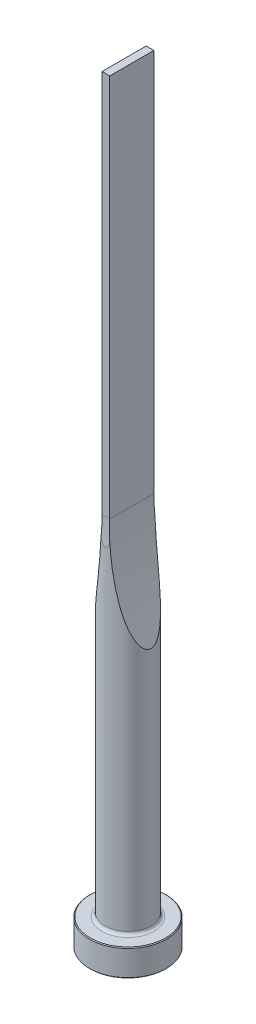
ISO-10303-21;
HEADER;
FILE_DESCRIPTION(('STEP AP214'),'2;1');
FILE_NAME('part.step','',(''),(''),'','','');
FILE_SCHEMA(('AUTOMOTIVE_DESIGN { 1 0 10303 214 1 1 1 1 }'));
ENDSEC;
DATA;
#1=APPLICATION_CONTEXT('core data for automotive mechanical design processes');
#2=APPLICATION_PROTOCOL_DEFINITION('international standard','automotive_design',2000,#1);
#3=PRODUCT_CONTEXT('',#1,'mechanical');
#4=PRODUCT('Part','Part','',(#3));
#5=PRODUCT_RELATED_PRODUCT_CATEGORY('part','',(#4));
#6=PRODUCT_DEFINITION_FORMATION('','',#4);
#7=PRODUCT_DEFINITION_CONTEXT('part definition',#1,'design');
#8=PRODUCT_DEFINITION('design','',#6,#7);
#9=PRODUCT_DEFINITION_SHAPE('','',#8);
#10=(LENGTH_UNIT() NAMED_UNIT(*) SI_UNIT(.MILLI.,.METRE.));
#11=(NAMED_UNIT(*) PLANE_ANGLE_UNIT() SI_UNIT($,.RADIAN.));
#12=(NAMED_UNIT(*) SI_UNIT($,.STERADIAN.) SOLID_ANGLE_UNIT());
#13=UNCERTAINTY_MEASURE_WITH_UNIT(LENGTH_MEASURE(1.E-05),#10,'distance_accuracy_value','');
#14=(GEOMETRIC_REPRESENTATION_CONTEXT(3) GLOBAL_UNCERTAINTY_ASSIGNED_CONTEXT((#13)) GLOBAL_UNIT_ASSIGNED_CONTEXT((#10,
#11,#12)) REPRESENTATION_CONTEXT('',''));
#15=CARTESIAN_POINT('',(0.,0.,0.));
#16=DIRECTION('',(0.,0.,1.));
#17=DIRECTION('',(1.,0.,0.));
#18=AXIS2_PLACEMENT_3D('',#15,#16,#17);
#19=CARTESIAN_POINT('',(0.,0.,0.));
#20=DIRECTION('',(0.,1.,0.));
#21=DIRECTION('',(-1.,0.,0.));
#22=AXIS2_PLACEMENT_3D('',#19,#20,#21);
#23=PLANE('',#22);
#24=CARTESIAN_POINT('',(0.,0.,0.));
#25=DIRECTION('',(0.,1.,0.));
#26=DIRECTION('',(-1.,0.,0.));
#27=AXIS2_PLACEMENT_3D('',#24,#25,#26);
#28=CIRCLE('',#27,9.8);
#29=CARTESIAN_POINT('',(-9.8,0.,0.));
#30=VERTEX_POINT('',#29);
#31=EDGE_CURVE('E133',#30,#30,#28,.T.);
#32=ORIENTED_EDGE('',*,*,#31,.F.);
#33=EDGE_LOOP('',(#32));
#34=FACE_BOUND('',#33,.T.);
#35=ADVANCED_FACE('F32',(#34),#23,.F.);
#36=CARTESIAN_POINT('',(0.,0.,0.));
#37=DIRECTION('',(0.,1.,0.));
#38=DIRECTION('',(-1.,0.,0.));
#39=AXIS2_PLACEMENT_3D('',#36,#37,#38);
#40=CONICAL_SURFACE('',#39,9.8,0.785398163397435);
#41=CARTESIAN_POINT('',(0.,0.200000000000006,0.));
#42=DIRECTION('',(0.,1.,0.));
#43=DIRECTION('',(-1.,0.,0.));
#44=AXIS2_PLACEMENT_3D('',#41,#42,#43);
#45=CIRCLE('',#44,10.);
#46=CARTESIAN_POINT('',(-10.,0.200000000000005,0.));
#47=VERTEX_POINT('',#46);
#48=EDGE_CURVE('E130',#47,#47,#45,.T.);
#49=ORIENTED_EDGE('',*,*,#48,.F.);
#50=EDGE_LOOP('',(#49));
#51=FACE_BOUND('',#50,.T.);
#52=ORIENTED_EDGE('',*,*,#31,.T.);
#53=EDGE_LOOP('',(#52));
#54=FACE_BOUND('',#53,.T.);
#55=ADVANCED_FACE('F171',(#51,#54),#40,.T.);
#56=CARTESIAN_POINT('',(0.,200.,0.));
#57=DIRECTION('',(0.,1.,0.));
#58=DIRECTION('',(-1.,0.,0.));
#59=AXIS2_PLACEMENT_3D('',#56,#57,#58);
#60=CYLINDRICAL_SURFACE('',#59,10.);
#61=CARTESIAN_POINT('',(0.,6.8,0.));
#62=DIRECTION('',(0.,1.,0.));
#63=DIRECTION('',(-1.,0.,0.));
#64=AXIS2_PLACEMENT_3D('',#61,#62,#63);
#65=CIRCLE('',#64,10.);
#66=CARTESIAN_POINT('',(-10.,6.8,0.));
#67=VERTEX_POINT('',#66);
#68=EDGE_CURVE('E127',#67,#67,#65,.T.);
#69=ORIENTED_EDGE('',*,*,#68,.F.);
#70=EDGE_LOOP('',(#69));
#71=FACE_BOUND('',#70,.T.);
#72=ORIENTED_EDGE('',*,*,#48,.T.);
#73=EDGE_LOOP('',(#72));
#74=FACE_BOUND('',#73,.T.);
#75=ADVANCED_FACE('F176',(#71,#74),#60,.T.);
#76=CARTESIAN_POINT('',(0.,6.8,0.));
#77=DIRECTION('',(0.,-1.,0.));
#78=DIRECTION('',(1.,0.,0.));
#79=AXIS2_PLACEMENT_3D('',#76,#77,#78);
#80=CONICAL_SURFACE('',#79,10.,0.785398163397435);
#81=CARTESIAN_POINT('',(0.,7.00000000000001,0.));
#82=DIRECTION('',(0.,1.,0.));
#83=DIRECTION('',(-1.,0.,0.));
#84=AXIS2_PLACEMENT_3D('',#81,#82,#83);
#85=CIRCLE('',#84,9.8);
#86=CARTESIAN_POINT('',(-9.8,7.00000000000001,0.));
#87=VERTEX_POINT('',#86);
#88=EDGE_CURVE('E124',#87,#87,#85,.T.);
#89=ORIENTED_EDGE('',*,*,#88,.F.);
#90=EDGE_LOOP('',(#89));
#91=FACE_BOUND('',#90,.T.);
#92=ORIENTED_EDGE('',*,*,#68,.T.);
#93=EDGE_LOOP('',(#92));
#94=FACE_BOUND('',#93,.T.);
#95=ADVANCED_FACE('F183',(#91,#94),#80,.T.);
#96=CARTESIAN_POINT('',(9.8,7.,0.));
#97=DIRECTION('',(0.,-1.,0.));
#98=DIRECTION('',(1.,0.,0.));
#99=AXIS2_PLACEMENT_3D('',#96,#97,#98);
#100=PLANE('',#99);
#101=CARTESIAN_POINT('',(0.,7.00000000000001,0.));
#102=DIRECTION('',(0.,1.,0.));
#103=DIRECTION('',(-1.,0.,0.));
#104=AXIS2_PLACEMENT_3D('',#101,#102,#103);
#105=CIRCLE('',#104,6.80000000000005);
#106=CARTESIAN_POINT('',(-6.80000000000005,7.00000000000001,0.));
#107=VERTEX_POINT('',#106);
#108=EDGE_CURVE('E121',#107,#107,#105,.T.);
#109=ORIENTED_EDGE('',*,*,#108,.F.);
#110=EDGE_LOOP('',(#109));
#111=FACE_BOUND('',#110,.T.);
#112=ORIENTED_EDGE('',*,*,#88,.T.);
#113=EDGE_LOOP('',(#112));
#114=FACE_BOUND('',#113,.T.);
#115=ADVANCED_FACE('F190',(#111,#114),#100,.F.);
#116=CARTESIAN_POINT('',(0.,7.8,0.));
#117=DIRECTION('',(0.,1.,0.));
#118=DIRECTION('',(-1.,0.,0.));
#119=AXIS2_PLACEMENT_3D('',#116,#117,#118);
#120=TOROIDAL_SURFACE('',#119,6.80000000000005,0.8);
#121=CARTESIAN_POINT('',(0.,7.8,0.));
#122=DIRECTION('',(0.,1.,0.));
#123=DIRECTION('',(-1.,0.,0.));
#124=AXIS2_PLACEMENT_3D('',#121,#122,#123);
#125=CIRCLE('',#124,6.00000000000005);
#126=CARTESIAN_POINT('',(-6.00000000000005,7.8,0.));
#127=VERTEX_POINT('',#126);
#128=EDGE_CURVE('E112',#127,#127,#125,.T.);
#129=ORIENTED_EDGE('',*,*,#128,.F.);
#130=EDGE_LOOP('',(#129));
#131=FACE_BOUND('',#130,.T.);
#132=ORIENTED_EDGE('',*,*,#108,.T.);
#133=EDGE_LOOP('',(#132));
#134=FACE_BOUND('',#133,.T.);
#135=ADVANCED_FACE('F168',(#131,#134),#120,.F.);
#136=CARTESIAN_POINT('',(0.,200.,0.));
#137=DIRECTION('',(0.,1.,0.));
#138=DIRECTION('',(-1.,0.,0.));
#139=AXIS2_PLACEMENT_3D('',#136,#137,#138);
#140=CYLINDRICAL_SURFACE('',#139,6.00000000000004);
#141=CARTESIAN_POINT('',(6.00000000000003,70.4196010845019,0.));
#142=CARTESIAN_POINT('',(5.99999775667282,70.4196071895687,0.125242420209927));
#143=CARTESIAN_POINT('',(5.99603096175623,70.4309988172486,0.250508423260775));
#144=CARTESIAN_POINT('',(5.98067932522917,70.4751693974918,0.496760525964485));
#145=CARTESIAN_POINT('',(5.96928446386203,70.5079772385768,0.61774061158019));
#146=CARTESIAN_POINT('',(5.93705304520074,70.6010551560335,0.878870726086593));
#147=CARTESIAN_POINT('',(5.91466618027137,70.6658515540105,1.01718646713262));
#148=CARTESIAN_POINT('',(5.86320143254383,70.8155561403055,1.28103782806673));
#149=CARTESIAN_POINT('',(5.83411053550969,70.9005034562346,1.40654789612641));
#150=CARTESIAN_POINT('',(5.7768157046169,71.0687821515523,1.62443423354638));
#151=CARTESIAN_POINT('',(5.74932751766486,71.1498551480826,1.71878790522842));
#152=CARTESIAN_POINT('',(5.69208960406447,71.3195459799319,1.89977178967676));
#153=CARTESIAN_POINT('',(5.66233827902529,71.4081691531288,1.98639644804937));
#154=CARTESIAN_POINT('',(5.60117877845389,71.5913624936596,2.15282854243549));
#155=CARTESIAN_POINT('',(5.56976730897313,71.6859445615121,2.23262153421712));
#156=CARTESIAN_POINT('',(5.50582406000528,71.8796108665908,2.38595788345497));
#157=CARTESIAN_POINT('',(5.4732925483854,71.9786940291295,2.45950272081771));
#158=CARTESIAN_POINT('',(5.39715737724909,72.2120040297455,2.62320522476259));
#159=CARTESIAN_POINT('',(5.3532716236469,72.347534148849,2.71136896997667));
#160=CARTESIAN_POINT('',(5.26471235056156,72.6233409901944,2.87955370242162));
#161=CARTESIAN_POINT('',(5.22003850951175,72.7636196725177,2.95957127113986));
#162=CARTESIAN_POINT('',(5.13024375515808,73.0480568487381,3.11263236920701));
#163=CARTESIAN_POINT('',(5.08512228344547,73.1922207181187,3.18566552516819));
#164=CARTESIAN_POINT('',(4.99477653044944,73.4834995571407,3.32552790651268));
#165=CARTESIAN_POINT('',(4.94955223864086,73.630614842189,3.39235646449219));
#166=CARTESIAN_POINT('',(4.85901090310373,73.9279027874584,3.52082581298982));
#167=CARTESIAN_POINT('',(4.81369435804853,74.078086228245,3.58244190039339));
#168=CARTESIAN_POINT('',(4.72333124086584,74.3804502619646,3.70076774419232));
#169=CARTESIAN_POINT('',(4.67828467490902,74.5326309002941,3.7574773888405));
#170=CARTESIAN_POINT('',(4.58862652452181,74.838523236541,3.8664557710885));
#171=CARTESIAN_POINT('',(4.54401457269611,74.9922333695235,3.91872861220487));
#172=CARTESIAN_POINT('',(4.45527805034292,75.3010744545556,4.01932733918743));
#173=CARTESIAN_POINT('',(4.41115348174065,75.4562054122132,4.0676532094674));
#174=CARTESIAN_POINT('',(4.29641025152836,75.8638040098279,4.18945912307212));
#175=CARTESIAN_POINT('',(4.22624526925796,76.1172623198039,4.26005871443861));
#176=CARTESIAN_POINT('',(4.08762442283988,76.6267524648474,4.39323954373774));
#177=CARTESIAN_POINT('',(4.01916875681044,76.8827845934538,4.45581985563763));
#178=CARTESIAN_POINT('',(3.88411563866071,77.3970490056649,4.5740248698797));
#179=CARTESIAN_POINT('',(3.81751897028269,77.6552821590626,4.62964667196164));
#180=CARTESIAN_POINT('',(3.68633760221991,78.1735063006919,4.73476129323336));
#181=CARTESIAN_POINT('',(3.62175301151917,78.4334973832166,4.78425378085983));
#182=CARTESIAN_POINT('',(3.43093594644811,79.2166410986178,4.92481121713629));
#183=CARTESIAN_POINT('',(3.30788392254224,79.7420369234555,5.00774895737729));
#184=CARTESIAN_POINT('',(3.07078215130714,80.7972602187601,5.15653257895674));
#185=CARTESIAN_POINT('',(2.95673337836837,81.3270881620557,5.22237661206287));
#186=CARTESIAN_POINT('',(2.79250802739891,82.1250901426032,5.31090921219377));
#187=CARTESIAN_POINT('',(2.73884045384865,82.3919928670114,5.33874481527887));
#188=CARTESIAN_POINT('',(2.63387849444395,82.9265482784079,5.39130136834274));
#189=CARTESIAN_POINT('',(2.5825839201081,83.1942009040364,5.41602256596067));
#190=CARTESIAN_POINT('',(2.43228253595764,83.9982264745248,5.48600462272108));
#191=CARTESIAN_POINT('',(2.33686353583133,84.5356405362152,5.52708106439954));
#192=CARTESIAN_POINT('',(2.15582892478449,85.6121272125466,5.60016992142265));
#193=CARTESIAN_POINT('',(2.07020309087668,86.1511974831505,5.63219184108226));
#194=CARTESIAN_POINT('',(1.90872365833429,87.2311865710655,5.68894511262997));
#195=CARTESIAN_POINT('',(1.83287021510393,87.7721054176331,5.71367634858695));
#196=CARTESIAN_POINT('',(1.69120784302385,88.8538643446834,5.75719432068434));
#197=CARTESIAN_POINT('',(1.6253699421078,89.3946999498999,5.77599837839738));
#198=CARTESIAN_POINT('',(1.50351191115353,90.4776302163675,5.80890983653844));
#199=CARTESIAN_POINT('',(1.44749203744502,91.0197249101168,5.82301711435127));
#200=CARTESIAN_POINT('',(1.34529714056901,92.1049798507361,5.84747253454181));
#201=CARTESIAN_POINT('',(1.29912312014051,92.648140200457,5.8578202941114));
#202=CARTESIAN_POINT('',(1.21664859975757,93.7352596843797,5.87550372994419));
#203=CARTESIAN_POINT('',(1.18034813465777,94.2792188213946,5.88283939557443));
#204=CARTESIAN_POINT('',(1.11760674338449,95.368246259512,5.89508076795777));
#205=CARTESIAN_POINT('',(1.09117513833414,95.9133151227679,5.89998417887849));
#206=CARTESIAN_POINT('',(1.04823003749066,97.0038584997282,5.90776520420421));
#207=CARTESIAN_POINT('',(1.03171656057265,97.5493330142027,5.91064281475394));
#208=CARTESIAN_POINT('',(1.00861478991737,98.6404623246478,5.91462876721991));
#209=CARTESIAN_POINT('',(1.0020258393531,99.186117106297,5.91573722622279));
#210=CARTESIAN_POINT('',(0.998773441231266,100.277468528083,5.91628720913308));
#211=CARTESIAN_POINT('',(1.00211020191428,100.823165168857,5.91572869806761));
#212=CARTESIAN_POINT('',(1.01869111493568,101.913263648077,5.91289599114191));
#213=CARTESIAN_POINT('',(1.03191456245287,102.457665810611,5.91062538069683));
#214=CARTESIAN_POINT('',(1.06823946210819,103.546117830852,5.90416844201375));
#215=CARTESIAN_POINT('',(1.09134070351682,104.090167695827,5.89998215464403));
#216=CARTESIAN_POINT('',(1.14741473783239,105.177785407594,5.8893339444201));
#217=CARTESIAN_POINT('',(1.18038841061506,105.721353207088,5.88287181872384));
#218=CARTESIAN_POINT('',(1.25619292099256,106.807759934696,5.86715249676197));
#219=CARTESIAN_POINT('',(1.29902372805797,107.350598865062,5.85789530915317));
#220=CARTESIAN_POINT('',(1.3944799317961,108.434849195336,5.83590809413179));
#221=CARTESIAN_POINT('',(1.4470964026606,108.976261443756,5.82318122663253));
#222=CARTESIAN_POINT('',(1.56212230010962,110.057923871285,5.79338465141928));
#223=CARTESIAN_POINT('',(1.62453165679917,110.598174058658,5.77631497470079));
#224=CARTESIAN_POINT('',(1.7590950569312,111.677175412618,5.7367675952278));
#225=CARTESIAN_POINT('',(1.83124753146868,112.215926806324,5.71429076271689));
#226=CARTESIAN_POINT('',(1.98524953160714,113.291705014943,5.66263106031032));
#227=CARTESIAN_POINT('',(2.06709862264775,113.828731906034,5.63344849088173));
#228=CARTESIAN_POINT('',(2.21300385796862,114.731161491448,5.57733188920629));
#229=CARTESIAN_POINT('',(2.27449844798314,115.09711766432,5.55260662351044));
#230=CARTESIAN_POINT('',(2.40194906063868,115.827916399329,5.49867559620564));
#231=CARTESIAN_POINT('',(2.46790497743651,116.192758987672,5.46946994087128));
#232=CARTESIAN_POINT('',(2.6042494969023,116.921248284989,5.40588058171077));
#233=CARTESIAN_POINT('',(2.67463906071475,117.284894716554,5.37149575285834));
#234=CARTESIAN_POINT('',(2.81977842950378,118.010704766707,5.29674573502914));
#235=CARTESIAN_POINT('',(2.89452823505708,118.372868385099,5.25638054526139));
#236=CARTESIAN_POINT('',(3.04820460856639,119.094966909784,5.16877779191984));
#237=CARTESIAN_POINT('',(3.12712545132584,119.454904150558,5.12154950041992));
#238=CARTESIAN_POINT('',(3.28912302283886,120.172689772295,5.01904986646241));
#239=CARTESIAN_POINT('',(3.37219962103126,120.530538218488,4.96377877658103));
#240=CARTESIAN_POINT('',(3.54231681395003,121.24353801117,4.8438438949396));
#241=CARTESIAN_POINT('',(3.62935549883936,121.598690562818,4.77918459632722));
#242=CARTESIAN_POINT('',(3.80720655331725,122.305820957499,4.63875280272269));
#243=CARTESIAN_POINT('',(3.89801851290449,122.657799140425,4.56298151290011));
#244=CARTESIAN_POINT('',(4.08342709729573,123.358966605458,4.39785138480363));
#245=CARTESIAN_POINT('',(4.17803592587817,123.708141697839,4.3084456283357));
#246=CARTESIAN_POINT('',(4.37029964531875,124.401317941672,4.11330947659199));
#247=CARTESIAN_POINT('',(4.46795582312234,124.745316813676,4.00757210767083));
#248=CARTESIAN_POINT('',(4.61614246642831,125.255904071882,3.83366636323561));
#249=CARTESIAN_POINT('',(4.66586049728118,125.425325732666,3.77309553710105));
#250=CARTESIAN_POINT('',(4.76568777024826,125.761874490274,3.64619669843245));
#251=CARTESIAN_POINT('',(4.81579697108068,125.929001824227,3.57986928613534));
#252=CARTESIAN_POINT('',(4.91617313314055,126.260325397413,3.44072598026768));
#253=CARTESIAN_POINT('',(4.96643993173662,126.424523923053,3.36791544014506));
#254=CARTESIAN_POINT('',(5.06689358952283,126.749394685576,3.21480576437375));
#255=CARTESIAN_POINT('',(5.11708046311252,126.910067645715,3.13450818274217));
#256=CARTESIAN_POINT('',(5.21752644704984,127.228576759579,2.96433606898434));
#257=CARTESIAN_POINT('',(5.26778094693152,127.386366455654,2.87437116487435));
#258=CARTESIAN_POINT('',(5.36725447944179,127.695834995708,2.68404781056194));
#259=CARTESIAN_POINT('',(5.41647403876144,127.847516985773,2.58369480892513));
#260=CARTESIAN_POINT('',(5.51277525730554,128.141752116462,2.37125323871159));
#261=CARTESIAN_POINT('',(5.55986802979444,128.284354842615,2.25923918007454));
#262=CARTESIAN_POINT('',(5.6509052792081,128.557883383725,2.02077972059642));
#263=CARTESIAN_POINT('',(5.69485490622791,128.688828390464,1.89435885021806));
#264=CARTESIAN_POINT('',(5.76730290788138,128.903231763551,1.65813330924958));
#265=CARTESIAN_POINT('',(5.79691960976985,128.990384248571,1.55205897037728));
#266=CARTESIAN_POINT('',(5.85202977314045,129.151851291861,1.32925640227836));
#267=CARTESIAN_POINT('',(5.87752021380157,129.226156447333,1.21252046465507));
#268=CARTESIAN_POINT('',(5.92291805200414,129.358049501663,0.966850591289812));
#269=CARTESIAN_POINT('',(5.94275517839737,129.415427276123,0.837787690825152));
#270=CARTESIAN_POINT('',(5.97430478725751,129.506499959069,0.570644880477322));
#271=CARTESIAN_POINT('',(5.98603519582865,129.540247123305,0.432585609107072));
#272=CARTESIAN_POINT('',(5.99919214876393,129.578084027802,0.162766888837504));
#273=CARTESIAN_POINT('',(6.00134328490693,129.584259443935,0.0313422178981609));
#274=CARTESIAN_POINT('',(5.9970090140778,129.571803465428,-0.230194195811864));
#275=CARTESIAN_POINT('',(5.99052146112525,129.553165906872,-0.360305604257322));
#276=CARTESIAN_POINT('',(5.97128614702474,129.497771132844,-0.596490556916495));
#277=CARTESIAN_POINT('',(5.95955071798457,129.463941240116,-0.703365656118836));
#278=CARTESIAN_POINT('',(5.93136732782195,129.382471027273,-0.910966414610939));
#279=CARTESIAN_POINT('',(5.91491844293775,129.334827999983,-1.01169086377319));
#280=CARTESIAN_POINT('',(5.86553987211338,129.191312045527,-1.27427049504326));
#281=CARTESIAN_POINT('',(5.82912016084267,129.084985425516,-1.42972634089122));
#282=CARTESIAN_POINT('',(5.74961855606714,128.851132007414,-1.72190983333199));
#283=CARTESIAN_POINT('',(5.70651443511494,128.723534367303,-1.85857201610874));
#284=CARTESIAN_POINT('',(5.61897824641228,128.462238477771,-2.10794871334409));
#285=CARTESIAN_POINT('',(5.57477388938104,128.32934207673,-2.22159958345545));
#286=CARTESIAN_POINT('',(5.48416424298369,128.054639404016,-2.43671420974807));
#287=CARTESIAN_POINT('',(5.43775690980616,127.912824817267,-2.53816632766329));
#288=CARTESIAN_POINT('',(5.34358322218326,127.622483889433,-2.73086631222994));
#289=CARTESIAN_POINT('',(5.29581433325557,127.473944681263,-2.82209334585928));
#290=CARTESIAN_POINT('',(5.19962805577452,127.172068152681,-2.99561144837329));
#291=CARTESIAN_POINT('',(5.15121092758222,127.018732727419,-3.07790599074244));
#292=CARTESIAN_POINT('',(5.02856678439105,126.626569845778,-3.27618912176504));
#293=CARTESIAN_POINT('',(4.95417194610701,126.385234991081,-3.38710592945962));
#294=CARTESIAN_POINT('',(4.80575902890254,125.896297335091,-3.59456631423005));
#295=CARTESIAN_POINT('',(4.73174116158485,125.648691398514,-3.6911025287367));
#296=CARTESIAN_POINT('',(4.58458577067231,125.148444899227,-3.87236575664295));
#297=CARTESIAN_POINT('',(4.51145000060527,124.895796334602,-3.95707195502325));
#298=CARTESIAN_POINT('',(4.36658882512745,124.38692436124,-4.116367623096));
#299=CARTESIAN_POINT('',(4.29486358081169,124.130700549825,-4.19095594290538));
#300=CARTESIAN_POINT('',(4.15278444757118,123.614258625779,-4.33179261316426));
#301=CARTESIAN_POINT('',(4.08243835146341,123.354027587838,-4.39800116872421));
#302=CARTESIAN_POINT('',(3.94365659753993,122.83125536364,-4.52286201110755));
#303=CARTESIAN_POINT('',(3.87522100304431,122.568714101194,-4.5815140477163));
#304=CARTESIAN_POINT('',(3.74048483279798,122.042023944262,-4.69215969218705));
#305=CARTESIAN_POINT('',(3.674181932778,121.77787720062,-4.74416074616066));
#306=CARTESIAN_POINT('',(3.54373924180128,121.247986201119,-4.84237219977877));
#307=CARTESIAN_POINT('',(3.47959944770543,120.982241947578,-4.88858260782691));
#308=CARTESIAN_POINT('',(3.31010347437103,120.265635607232,-5.00599993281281));
#309=CARTESIAN_POINT('',(3.20682871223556,119.813500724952,-5.07246697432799));
#310=CARTESIAN_POINT('',(3.00696752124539,118.906139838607,-5.19343466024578));
#311=CARTESIAN_POINT('',(2.91038185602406,118.45091348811,-5.24793393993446));
#312=CARTESIAN_POINT('',(2.7240551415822,117.53780956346,-5.34702333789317));
#313=CARTESIAN_POINT('',(2.63431680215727,117.079931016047,-5.39160954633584));
#314=CARTESIAN_POINT('',(2.46185131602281,116.162124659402,-5.47250894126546));
#315=CARTESIAN_POINT('',(2.37912435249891,115.702196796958,-5.50882191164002));
#316=CARTESIAN_POINT('',(2.22060946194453,114.779692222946,-5.57460936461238));
#317=CARTESIAN_POINT('',(2.14483606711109,114.317112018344,-5.6040697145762));
#318=CARTESIAN_POINT('',(2.00048108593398,113.390500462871,-5.65720666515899));
#319=CARTESIAN_POINT('',(1.93189955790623,112.926469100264,-5.68088321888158));
#320=CARTESIAN_POINT('',(1.80198761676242,111.997274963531,-5.72341801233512));
#321=CARTESIAN_POINT('',(1.74065566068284,111.53211245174,-5.74227727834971));
#322=CARTESIAN_POINT('',(1.62525795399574,110.600740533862,-5.77599627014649));
#323=CARTESIAN_POINT('',(1.57119233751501,110.134531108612,-5.79085592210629));
#324=CARTESIAN_POINT('',(1.41952321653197,108.730777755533,-5.83061132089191));
#325=CARTESIAN_POINT('',(1.33297412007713,107.791873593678,-5.85052312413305));
#326=CARTESIAN_POINT('',(1.18941363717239,105.911655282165,-5.8813803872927));
#327=CARTESIAN_POINT('',(1.13240356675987,104.970341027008,-5.89232544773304));
#328=CARTESIAN_POINT('',(1.04805147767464,103.087652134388,-5.90791250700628));
#329=CARTESIAN_POINT('',(1.0206679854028,102.146279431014,-5.9125633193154));
#330=CARTESIAN_POINT('',(0.995458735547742,100.263151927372,-5.91685902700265));
#331=CARTESIAN_POINT('',(0.997632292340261,99.3213971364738,-5.91650403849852));
#332=CARTESIAN_POINT('',(1.03154557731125,97.4377415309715,-5.91068654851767));
#333=CARTESIAN_POINT('',(1.06330697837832,96.4958411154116,-5.90522030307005));
#334=CARTESIAN_POINT('',(1.1563920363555,94.6135246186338,-5.88769860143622));
#335=CARTESIAN_POINT('',(1.21771697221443,93.6731086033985,-5.87564286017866));
#336=CARTESIAN_POINT('',(1.37003026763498,91.7926709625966,-5.84201750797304));
#337=CARTESIAN_POINT('',(1.4610854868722,90.8526550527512,-5.82042641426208));
#338=CARTESIAN_POINT('',(1.6197673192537,89.4455301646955,-5.77748168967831));
#339=CARTESIAN_POINT('',(1.67634191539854,88.9769890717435,-5.76140789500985));
#340=CARTESIAN_POINT('',(1.79683049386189,88.0410216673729,-5.72497854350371));
#341=CARTESIAN_POINT('',(1.86074431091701,87.5735953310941,-5.70462308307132));
#342=CARTESIAN_POINT('',(1.99506969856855,86.6456166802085,-5.65903386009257));
#343=CARTESIAN_POINT('',(2.06539470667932,86.1850488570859,-5.63386115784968));
#344=CARTESIAN_POINT('',(2.21312421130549,85.2654299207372,-5.57748469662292));
#345=CARTESIAN_POINT('',(2.2905284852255,84.8063787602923,-5.54628112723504));
#346=CARTESIAN_POINT('',(2.45239786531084,83.8897901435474,-5.47663362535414));
#347=CARTESIAN_POINT('',(2.53686705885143,83.4322537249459,-5.43818548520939));
#348=CARTESIAN_POINT('',(2.71272931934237,82.5193275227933,-5.3526318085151));
#349=CARTESIAN_POINT('',(2.80412221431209,82.0639376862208,-5.30552648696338));
#350=CARTESIAN_POINT('',(2.99332338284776,81.1575383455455,-5.2011202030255));
#351=CARTESIAN_POINT('',(3.0911051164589,80.706518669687,-5.14385991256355));
#352=CARTESIAN_POINT('',(3.29321309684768,79.8076318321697,-5.01687239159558));
#353=CARTESIAN_POINT('',(3.39754007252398,79.3597650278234,-4.94714377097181));
#354=CARTESIAN_POINT('',(3.61229869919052,78.4686393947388,-4.79257698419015));
#355=CARTESIAN_POINT('',(3.72272344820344,78.0253760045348,-4.70775566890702));
#356=CARTESIAN_POINT('',(3.94928670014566,77.1443668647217,-4.51939233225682));
#357=CARTESIAN_POINT('',(4.0654233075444,76.7066193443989,-4.41585649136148));
#358=CARTESIAN_POINT('',(4.20946974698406,76.1795631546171,-4.27569986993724));
#359=CARTESIAN_POINT('',(4.23504568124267,76.0865732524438,-4.25037819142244));
#360=CARTESIAN_POINT('',(4.28641223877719,75.9009758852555,-4.19857173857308));
#361=CARTESIAN_POINT('',(4.31220286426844,75.8083684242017,-4.17208695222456));
#362=CARTESIAN_POINT('',(4.38988595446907,75.5311425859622,-4.09078536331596));
#363=CARTESIAN_POINT('',(4.44208320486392,75.3471442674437,-4.03412754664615));
#364=CARTESIAN_POINT('',(4.5473186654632,74.9806005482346,-3.915127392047));
#365=CARTESIAN_POINT('',(4.60035886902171,74.7980608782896,-3.85276910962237));
#366=CARTESIAN_POINT('',(4.70696776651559,74.4354091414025,-3.72177186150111));
#367=CARTESIAN_POINT('',(4.76053642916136,74.2552969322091,-3.65313326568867));
#368=CARTESIAN_POINT('',(4.87563201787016,73.8726463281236,-3.49839982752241));
#369=CARTESIAN_POINT('',(4.93720737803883,73.6705610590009,-3.41121064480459));
#370=CARTESIAN_POINT('',(5.06030283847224,73.2715129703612,-3.22579089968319));
#371=CARTESIAN_POINT('',(5.12182294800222,73.074549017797,-3.12756280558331));
#372=CARTESIAN_POINT('',(5.24391728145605,72.6881863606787,-2.91821502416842));
#373=CARTESIAN_POINT('',(5.30449407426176,72.4987634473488,-2.80714197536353));
#374=CARTESIAN_POINT('',(5.42380766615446,72.1297152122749,-2.56905944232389));
#375=CARTESIAN_POINT('',(5.48254648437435,71.9500789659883,-2.44206827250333));
#376=CARTESIAN_POINT('',(5.58357518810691,71.6441509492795,-2.1992775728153));
#377=CARTESIAN_POINT('',(5.62658135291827,71.514981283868,-2.08743966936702));
#378=CARTESIAN_POINT('',(5.70919774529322,71.2685551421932,-1.84957852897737));
#379=CARTESIAN_POINT('',(5.74880272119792,71.1513170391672,-1.72353402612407));
#380=CARTESIAN_POINT('',(5.82301089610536,70.9329399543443,-1.45343537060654));
#381=CARTESIAN_POINT('',(5.85753618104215,70.8320497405,-1.30915348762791));
#382=CARTESIAN_POINT('',(5.91754549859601,70.6574624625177,-1.00330272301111));
#383=CARTESIAN_POINT('',(5.94306640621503,70.5836544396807,-0.841807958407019));
#384=CARTESIAN_POINT('',(5.97431451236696,70.4934884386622,-0.565200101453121));
#385=CARTESIAN_POINT('',(5.98385628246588,70.4660250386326,-0.454147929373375));
#386=CARTESIAN_POINT('',(5.99669757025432,70.4290857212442,-0.228735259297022));
#387=CARTESIAN_POINT('',(6.00000204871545,70.4195955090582,-0.114377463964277));
#388=CARTESIAN_POINT('',(6.00000000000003,70.4196010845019,0.));
#389=B_SPLINE_CURVE_WITH_KNOTS('',3,(#141,#142,#143,#144,#145,#146,#147,#148,#149,#150,#151,
#152,#153,#154,#155,#156,#157,#158,#159,#160,#161,#162,#163,#164,#165,#166,#167,#168,#169,#170,
#171,#172,#173,#174,#175,#176,#177,#178,#179,#180,#181,#182,#183,#184,#185,#186,#187,#188,#189,
#190,#191,#192,#193,#194,#195,#196,#197,#198,#199,#200,#201,#202,#203,#204,#205,#206,#207,#208,
#209,#210,#211,#212,#213,#214,#215,#216,#217,#218,#219,#220,#221,#222,#223,#224,#225,#226,#227,
#228,#229,#230,#231,#232,#233,#234,#235,#236,#237,#238,#239,#240,#241,#242,#243,#244,#245,#246,
#247,#248,#249,#250,#251,#252,#253,#254,#255,#256,#257,#258,#259,#260,#261,#262,#263,#264,#265,
#266,#267,#268,#269,#270,#271,#272,#273,#274,#275,#276,#277,#278,#279,#280,#281,#282,#283,#284,
#285,#286,#287,#288,#289,#290,#291,#292,#293,#294,#295,#296,#297,#298,#299,#300,#301,#302,#303,
#304,#305,#306,#307,#308,#309,#310,#311,#312,#313,#314,#315,#316,#317,#318,#319,#320,#321,#322,
#323,#324,#325,#326,#327,#328,#329,#330,#331,#332,#333,#334,#335,#336,#337,#338,#339,#340,#341,
#342,#343,#344,#345,#346,#347,#348,#349,#350,#351,#352,#353,#354,#355,#356,#357,#358,#359,#360,
#361,#362,#363,#364,#365,#366,#367,#368,#369,#370,#371,#372,#373,#374,#375,#376,#377,#378,#379,
#380,#381,#382,#383,#384,#385,#386,#387,#388),.UNSPECIFIED.,.T.,.F.,(4,2,2,2,2,2,2,2,2,2,2,2,2,
2,2,2,2,2,2,2,2,2,2,2,2,2,2,2,2,2,2,2,2,2,2,2,2,2,2,2,2,2,2,2,2,2,2,2,2,2,2,2,2,2,2,2,2,2,2,2,2,
2,2,2,2,2,2,2,2,2,2,2,2,2,2,2,2,2,2,2,2,2,2,2,2,2,2,2,2,2,2,2,2,2,2,2,2,2,2,2,2,2,2,2,2,2,2,2,2,
2,2,2,2,2,2,2,2,2,2,2,2,2,2,4),(0.,0.375228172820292,0.750963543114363,1.21148286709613,
1.67290382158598,2.0545728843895,2.43651405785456,2.81924379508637,3.20188262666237,
3.7041393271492,4.20660593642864,4.70980759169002,5.2130633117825,5.7185841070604,
6.22411641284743,6.72917594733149,7.23423747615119,8.05097248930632,8.86780173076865,
9.68497029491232,10.5021830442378,12.1395484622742,13.7770908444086,14.5980582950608,
15.418960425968,17.0608465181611,18.7010027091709,20.3411849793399,21.976528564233,
23.6119148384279,25.2474675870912,26.8830261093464,28.5201255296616,30.1572280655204,
31.79422224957,33.4312507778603,35.0648605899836,36.6984355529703,38.3321561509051,
39.9658716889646,41.5981043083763,43.230325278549,44.8622837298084,46.4941690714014,
47.6098499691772,48.7255044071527,49.8414015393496,50.9572988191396,52.0717022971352,
53.1860707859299,54.2999076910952,55.4136238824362,56.5312628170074,57.6493803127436,
58.209297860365,58.7691570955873,59.3285582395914,59.8878435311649,60.4529069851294,
61.017675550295,61.5790343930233,62.1394513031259,62.5599677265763,62.9807906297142,
63.4066365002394,63.8315376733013,64.2236842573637,64.6159282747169,64.9528337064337,
65.2898052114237,65.8619626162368,66.4360650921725,66.9763567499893,67.5171598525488,
68.0590455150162,68.6007196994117,69.4275798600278,70.2548619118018,71.0835817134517,
71.9123956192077,72.7450085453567,73.5776490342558,74.4093490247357,75.2410478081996,
76.6463331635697,78.0517786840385,79.4577775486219,80.8638131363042,82.2727232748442,
83.6816448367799,85.0902659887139,86.4989131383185,89.327615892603,92.1564446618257,
94.9813082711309,97.8061063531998,100.632975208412,103.459966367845,106.293359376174,
107.709950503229,109.126509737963,110.526178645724,111.925803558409,113.326243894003,
114.726649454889,116.121567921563,117.516642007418,118.910168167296,120.303234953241,
120.602364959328,120.90149805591,121.499839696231,122.099909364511,122.699943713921,
123.385305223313,124.070513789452,124.753308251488,125.435324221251,125.963134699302,
126.491746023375,127.027768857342,127.561570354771,127.904519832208,128.247196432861),.UNSPECIFIED.);
#390=CARTESIAN_POINT('',(1.14059027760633,94.9714331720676,-5.89059027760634));
#391=VERTEX_POINT('',#390);
#392=CARTESIAN_POINT('',(1.14059027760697,94.9714331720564,5.89059027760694));
#393=VERTEX_POINT('',#392);
#394=EDGE_CURVE('E138',#391,#393,#389,.T.);
#395=ORIENTED_EDGE('',*,*,#394,.T.);
#396=CARTESIAN_POINT('',(-1.71391365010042,100.,5.74999999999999));
#397=CARTESIAN_POINT('',(-1.71391988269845,100.360232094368,5.75000022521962));
#398=CARTESIAN_POINT('',(-1.70670690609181,100.7204849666,5.75216429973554));
#399=CARTESIAN_POINT('',(-1.67730271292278,101.440311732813,5.76080572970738));
#400=CARTESIAN_POINT('',(-1.65511191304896,101.799885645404,5.76728296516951));
#401=CARTESIAN_POINT('',(-1.59385315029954,102.518394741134,5.78452322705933));
#402=CARTESIAN_POINT('',(-1.55474710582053,102.877326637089,5.79529591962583));
#403=CARTESIAN_POINT('',(-1.48033674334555,103.413272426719,5.81457014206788));
#404=CARTESIAN_POINT('',(-1.45292096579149,103.591447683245,5.82151097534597));
#405=CARTESIAN_POINT('',(-1.39191289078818,103.946689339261,5.83640137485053));
#406=CARTESIAN_POINT('',(-1.35832152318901,104.123755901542,5.84435078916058));
#407=CARTESIAN_POINT('',(-1.2912787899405,104.440079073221,5.85948118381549));
#408=CARTESIAN_POINT('',(-1.25921382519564,104.579636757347,5.86648499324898));
#409=CARTESIAN_POINT('',(-1.18926063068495,104.857383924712,5.88106678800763));
#410=CARTESIAN_POINT('',(-1.15136840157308,104.995572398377,5.88864516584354));
#411=CARTESIAN_POINT('',(-1.06831244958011,105.269233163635,5.90427715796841));
#412=CARTESIAN_POINT('',(-1.02317340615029,105.404712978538,5.91232910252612));
#413=CARTESIAN_POINT('',(-0.923002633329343,105.671884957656,5.92880254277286));
#414=CARTESIAN_POINT('',(-0.867986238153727,105.803582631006,5.93722345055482));
#415=CARTESIAN_POINT('',(-0.766634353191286,106.011378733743,5.9509479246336));
#416=CARTESIAN_POINT('',(-0.724867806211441,106.089690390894,5.95622768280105));
#417=CARTESIAN_POINT('',(-0.633381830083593,106.241543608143,5.96665610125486));
#418=CARTESIAN_POINT('',(-0.5836819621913,106.315096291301,5.97180504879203));
#419=CARTESIAN_POINT('',(-0.500547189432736,106.418351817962,5.97914745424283));
#420=CARTESIAN_POINT('',(-0.47147887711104,106.451525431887,5.98152654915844));
#421=CARTESIAN_POINT('',(-0.40975608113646,106.514467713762,5.98607241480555));
#422=CARTESIAN_POINT('',(-0.377102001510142,106.54423676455,5.98823920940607));
#423=CARTESIAN_POINT('',(-0.314953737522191,106.592746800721,5.99179060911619));
#424=CARTESIAN_POINT('',(-0.286256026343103,106.612487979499,5.99324366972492));
#425=CARTESIAN_POINT('',(-0.226115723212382,106.647269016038,5.99581280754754));
#426=CARTESIAN_POINT('',(-0.194679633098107,106.662319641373,5.9969296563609));
#427=CARTESIAN_POINT('',(-0.137318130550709,106.683161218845,5.99847946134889));
#428=CARTESIAN_POINT('',(-0.11189510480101,106.690310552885,5.99901243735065));
#429=CARTESIAN_POINT('',(-0.060206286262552,106.700243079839,5.99975337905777));
#430=CARTESIAN_POINT('',(-0.0339414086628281,106.703030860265,5.99996168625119));
#431=CARTESIAN_POINT('',(0.0187279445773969,106.703927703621,6.00002867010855));
#432=CARTESIAN_POINT('',(0.045132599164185,106.702026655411,5.99988659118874));
#433=CARTESIAN_POINT('',(0.0972283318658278,106.693750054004,5.999268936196));
#434=CARTESIAN_POINT('',(0.122918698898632,106.687370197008,5.99879303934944));
#435=CARTESIAN_POINT('',(0.180222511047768,106.668376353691,5.99737959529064));
#436=CARTESIAN_POINT('',(0.211408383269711,106.654495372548,5.99634851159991));
#437=CARTESIAN_POINT('',(0.271170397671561,106.62198630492,5.99394413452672));
#438=CARTESIAN_POINT('',(0.299740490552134,106.603347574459,5.99257007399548));
#439=CARTESIAN_POINT('',(0.373829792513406,106.548222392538,5.988527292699));
#440=CARTESIAN_POINT('',(0.416890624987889,106.508492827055,5.98563453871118));
#441=CARTESIAN_POINT('',(0.497042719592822,106.423494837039,5.97951175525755));
#442=CARTESIAN_POINT('',(0.534115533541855,106.378210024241,5.97628073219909));
#443=CARTESIAN_POINT('',(0.619887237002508,106.262394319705,5.968113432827));
#444=CARTESIAN_POINT('',(0.665945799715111,106.189938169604,5.96308457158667));
#445=CARTESIAN_POINT('',(0.751194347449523,106.041041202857,5.95294302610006));
#446=CARTESIAN_POINT('',(0.790368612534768,105.964591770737,5.94783017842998));
#447=CARTESIAN_POINT('',(0.863732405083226,105.808846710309,5.93762100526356));
#448=CARTESIAN_POINT('',(0.897893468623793,105.72953779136,5.93252492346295));
#449=CARTESIAN_POINT('',(0.962086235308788,105.569384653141,5.9224519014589));
#450=CARTESIAN_POINT('',(0.99212236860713,105.488542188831,5.91747483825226));
#451=CARTESIAN_POINT('',(1.07256047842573,105.257924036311,5.903594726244));
#452=CARTESIAN_POINT('',(1.11909878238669,105.106793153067,5.8948729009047));
#453=CARTESIAN_POINT('',(1.20416724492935,104.802231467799,5.87808063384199));
#454=CARTESIAN_POINT('',(1.242692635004,104.648799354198,5.87001058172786));
#455=CARTESIAN_POINT('',(1.31348491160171,104.340145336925,5.85457710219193));
#456=CARTESIAN_POINT('',(1.34573891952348,104.184920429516,5.84721514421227));
#457=CARTESIAN_POINT('',(1.40500539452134,103.873431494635,5.83325598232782));
#458=CARTESIAN_POINT('',(1.43201709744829,103.717167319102,5.82665888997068));
#459=CARTESIAN_POINT('',(1.50637758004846,103.247239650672,5.80805390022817));
#460=CARTESIAN_POINT('',(1.54704655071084,102.932464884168,5.79723348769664));
#461=CARTESIAN_POINT('',(1.61419698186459,102.301766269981,5.77888587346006));
#462=CARTESIAN_POINT('',(1.64069532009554,101.985844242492,5.77135475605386));
#463=CARTESIAN_POINT('',(1.68834801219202,101.246171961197,5.75763237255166));
#464=CARTESIAN_POINT('',(1.70466595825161,100.822080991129,5.75275515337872));
#465=CARTESIAN_POINT('',(1.71726032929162,99.9732908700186,5.7490021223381));
#466=CARTESIAN_POINT('',(1.71352141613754,99.5485915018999,5.7501309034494));
#467=CARTESIAN_POINT('',(1.68556859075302,98.6993964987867,5.75839581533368));
#468=CARTESIAN_POINT('',(1.66133235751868,98.2749015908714,5.76553849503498));
#469=CARTESIAN_POINT('',(1.6074302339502,97.639971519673,5.78069922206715));
#470=CARTESIAN_POINT('',(1.58655066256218,97.4287184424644,5.78649055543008));
#471=CARTESIAN_POINT('',(1.5381997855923,97.0070234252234,5.79953269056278));
#472=CARTESIAN_POINT('',(1.51072919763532,96.7965813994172,5.80678333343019));
#473=CARTESIAN_POINT('',(1.44802861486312,96.3762167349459,5.82273739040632));
#474=CARTESIAN_POINT('',(1.41277459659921,96.1662977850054,5.83144528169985));
#475=CARTESIAN_POINT('',(1.33275702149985,95.7480308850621,5.85025220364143));
#476=CARTESIAN_POINT('',(1.28798068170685,95.5396854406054,5.86035309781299));
#477=CARTESIAN_POINT('',(1.18625496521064,95.126695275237,5.88179991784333));
#478=CARTESIAN_POINT('',(1.12934956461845,94.9220400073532,5.89314127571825));
#479=CARTESIAN_POINT('',(1.0306505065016,94.6196788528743,5.91090853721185));
#480=CARTESIAN_POINT('',(0.995571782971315,94.5197661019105,5.91694999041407));
#481=CARTESIAN_POINT('',(0.919681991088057,94.3221755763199,5.92922251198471));
#482=CARTESIAN_POINT('',(0.878874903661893,94.2244963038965,5.93545344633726));
#483=CARTESIAN_POINT('',(0.78930044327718,94.0321154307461,5.94803051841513));
#484=CARTESIAN_POINT('',(0.740485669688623,93.9374358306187,5.95437712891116));
#485=CARTESIAN_POINT('',(0.631843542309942,93.7548335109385,5.96689426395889));
#486=CARTESIAN_POINT('',(0.572086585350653,93.6668724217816,5.97306563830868));
#487=CARTESIAN_POINT('',(0.479606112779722,93.5579485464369,5.98084712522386));
#488=CARTESIAN_POINT('',(0.454538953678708,93.5305824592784,5.9828159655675));
#489=CARTESIAN_POINT('',(0.401755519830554,93.4783815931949,5.98659336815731));
#490=CARTESIAN_POINT('',(0.37403487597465,93.4535511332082,5.98840165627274));
#491=CARTESIAN_POINT('',(0.315263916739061,93.4073263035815,5.99178479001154));
#492=CARTESIAN_POINT('',(0.284178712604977,93.3859751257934,5.9933566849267));
#493=CARTESIAN_POINT('',(0.218804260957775,93.3488867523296,5.99609735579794));
#494=CARTESIAN_POINT('',(0.184526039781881,93.3331310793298,5.99726745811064));
#495=CARTESIAN_POINT('',(0.124190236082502,93.3129968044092,5.99876570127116));
#496=CARTESIAN_POINT('',(0.0988107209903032,93.3066143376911,5.99924175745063));
#497=CARTESIAN_POINT('',(0.0473358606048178,93.2982188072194,5.99986825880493));
#498=CARTESIAN_POINT('',(0.0212412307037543,93.296201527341,6.00001901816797));
#499=CARTESIAN_POINT('',(-0.0309265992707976,93.2967631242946,5.99997707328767));
#500=CARTESIAN_POINT('',(-0.0569997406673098,93.2993472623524,5.99978397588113));
#501=CARTESIAN_POINT('',(-0.108346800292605,93.3088258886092,5.99907682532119));
#502=CARTESIAN_POINT('',(-0.133619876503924,93.3157247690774,5.9985624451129));
#503=CARTESIAN_POINT('',(-0.19109305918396,93.3361090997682,5.99704633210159));
#504=CARTESIAN_POINT('',(-0.222776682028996,93.3510269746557,5.99593905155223));
#505=CARTESIAN_POINT('',(-0.283384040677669,93.3856448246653,5.99338125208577));
#506=CARTESIAN_POINT('',(-0.31230103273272,93.4053560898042,5.99192992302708));
#507=CARTESIAN_POINT('',(-0.388084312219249,93.4640516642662,5.98763173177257));
#508=CARTESIAN_POINT('',(-0.432258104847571,93.5064480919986,5.98455118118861));
#509=CARTESIAN_POINT('',(-0.514319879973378,93.5968518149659,5.97805681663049));
#510=CARTESIAN_POINT('',(-0.552188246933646,93.6448758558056,5.97464201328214));
#511=CARTESIAN_POINT('',(-0.640778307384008,93.7689866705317,5.96592566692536));
#512=CARTESIAN_POINT('',(-0.688534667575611,93.8471585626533,5.96052987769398));
#513=CARTESIAN_POINT('',(-0.776702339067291,94.0075955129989,5.94967920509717));
#514=CARTESIAN_POINT('',(-0.817096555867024,94.0898695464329,5.94422421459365));
#515=CARTESIAN_POINT('',(-0.892584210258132,94.2573402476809,5.93335936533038));
#516=CARTESIAN_POINT('',(-0.927647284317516,94.3425504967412,5.9279499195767));
#517=CARTESIAN_POINT('',(-0.993403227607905,94.5145145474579,5.91728393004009));
#518=CARTESIAN_POINT('',(-1.024100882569,94.60126653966,5.91202722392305));
#519=CARTESIAN_POINT('',(-1.10677762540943,94.8505228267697,5.8972918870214));
#520=CARTESIAN_POINT('',(-1.15453716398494,95.0144369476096,5.88804238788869));
#521=CARTESIAN_POINT('',(-1.2414245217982,95.3446081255,5.87033197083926));
#522=CARTESIAN_POINT('',(-1.28054721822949,95.5108665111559,5.86187152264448));
#523=CARTESIAN_POINT('',(-1.35203825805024,95.8452101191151,5.84579663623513));
#524=CARTESIAN_POINT('',(-1.3843927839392,96.0132983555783,5.83818394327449));
#525=CARTESIAN_POINT('',(-1.44343566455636,96.3505133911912,5.82386503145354));
#526=CARTESIAN_POINT('',(-1.47012321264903,96.5196403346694,5.81715894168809));
#527=CARTESIAN_POINT('',(-1.54288517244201,97.0277771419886,5.79845386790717));
#528=CARTESIAN_POINT('',(-1.58172719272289,97.3678811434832,5.78785176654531));
#529=CARTESIAN_POINT('',(-1.64387131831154,98.049158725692,5.77050081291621));
#530=CARTESIAN_POINT('',(-1.66719057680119,98.3903307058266,5.76374770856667));
#531=CARTESIAN_POINT('',(-1.6938276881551,98.9431148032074,5.75595770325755));
#532=CARTESIAN_POINT('',(-1.70138185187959,99.1545160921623,5.75372300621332));
#533=CARTESIAN_POINT('',(-1.71142095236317,99.5772759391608,5.75074469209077));
#534=CARTESIAN_POINT('',(-1.71390999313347,99.7886343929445,5.74999986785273));
#535=CARTESIAN_POINT('',(-1.71391365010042,100.,5.74999999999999));
#536=B_SPLINE_CURVE_WITH_KNOTS('',3,(#396,#397,#398,#399,#400,#401,#402,#403,#404,#405,#406,
#407,#408,#409,#410,#411,#412,#413,#414,#415,#416,#417,#418,#419,#420,#421,#422,#423,#424,#425,
#426,#427,#428,#429,#430,#431,#432,#433,#434,#435,#436,#437,#438,#439,#440,#441,#442,#443,#444,
#445,#446,#447,#448,#449,#450,#451,#452,#453,#454,#455,#456,#457,#458,#459,#460,#461,#462,#463,
#464,#465,#466,#467,#468,#469,#470,#471,#472,#473,#474,#475,#476,#477,#478,#479,#480,#481,#482,
#483,#484,#485,#486,#487,#488,#489,#490,#491,#492,#493,#494,#495,#496,#497,#498,#499,#500,#501,
#502,#503,#504,#505,#506,#507,#508,#509,#510,#511,#512,#513,#514,#515,#516,#517,#518,#519,#520,
#521,#522,#523,#524,#525,#526,#527,#528,#529,#530,#531,#532,#533,#534,#535),.UNSPECIFIED.,.T.,
.F.,(4,2,2,2,2,2,2,2,2,2,2,2,2,2,2,2,2,2,2,2,2,2,2,2,2,2,2,2,2,2,2,2,2,2,2,2,2,2,2,2,2,2,2,2,2,
2,2,2,2,2,2,2,2,2,2,2,2,2,2,2,2,2,2,2,2,2,2,2,2,4),(0.,1.08064493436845,2.16125980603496,
3.24432025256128,3.78545511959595,4.326508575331,4.75651025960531,5.18680838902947,
5.61567104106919,6.0438735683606,6.31035401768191,6.57618727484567,6.70851662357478,
6.84083107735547,6.94511015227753,7.04914805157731,7.12806303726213,7.20689496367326,
7.28589703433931,7.36497512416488,7.46685047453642,7.56895576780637,7.7439433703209,
7.91946020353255,8.17682522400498,8.43477049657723,8.69412793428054,8.95320460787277,
9.4279757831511,9.90302869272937,10.3790470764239,10.855134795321,11.8073834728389,
12.7584954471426,14.0312004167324,15.3048788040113,16.5799459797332,17.2169454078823,
17.8538755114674,18.4927996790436,19.1325870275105,19.7700930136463,20.0881688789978,
20.406024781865,20.7258349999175,21.0436557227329,21.1550136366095,21.2665581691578,
21.3793963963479,21.491858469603,21.5700494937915,21.6481649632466,21.7263698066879,
21.8046543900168,21.9091703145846,22.0139348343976,22.1968116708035,22.3802471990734,
22.6548472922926,22.930077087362,23.2068200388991,23.4832572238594,23.9958214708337,
24.5086889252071,25.022593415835,25.5365710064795,26.5634918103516,27.5892759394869,
28.2238570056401,28.8579236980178),.UNSPECIFIED.);
#537=CARTESIAN_POINT('',(-1.14059027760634,94.9714331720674,5.89059027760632));
#538=VERTEX_POINT('',#537);
#539=EDGE_CURVE('E104',#393,#538,#536,.T.);
#540=ORIENTED_EDGE('',*,*,#539,.T.);
#541=CARTESIAN_POINT('',(-6.00000000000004,70.4196010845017,0.));
#542=CARTESIAN_POINT('',(-5.99999775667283,70.4196071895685,-0.125242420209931));
#543=CARTESIAN_POINT('',(-5.99603096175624,70.4309988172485,-0.250508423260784));
#544=CARTESIAN_POINT('',(-5.98067932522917,70.4751693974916,-0.496760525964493));
#545=CARTESIAN_POINT('',(-5.96928446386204,70.5079772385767,-0.617740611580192));
#546=CARTESIAN_POINT('',(-5.93705304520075,70.6010551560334,-0.878870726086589));
#547=CARTESIAN_POINT('',(-5.91466618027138,70.6658515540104,-1.01718646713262));
#548=CARTESIAN_POINT('',(-5.86320143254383,70.8155561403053,-1.28103782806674));
#549=CARTESIAN_POINT('',(-5.8341105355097,70.9005034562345,-1.40654789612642));
#550=CARTESIAN_POINT('',(-5.77681570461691,71.0687821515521,-1.62443423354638));
#551=CARTESIAN_POINT('',(-5.74932751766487,71.1498551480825,-1.71878790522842));
#552=CARTESIAN_POINT('',(-5.69208960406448,71.3195459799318,-1.89977178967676));
#553=CARTESIAN_POINT('',(-5.6623382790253,71.4081691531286,-1.98639644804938));
#554=CARTESIAN_POINT('',(-5.60117877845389,71.5913624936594,-2.15282854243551));
#555=CARTESIAN_POINT('',(-5.56976730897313,71.6859445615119,-2.23262153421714));
#556=CARTESIAN_POINT('',(-5.50582406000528,71.8796108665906,-2.38595788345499));
#557=CARTESIAN_POINT('',(-5.4732925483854,71.9786940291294,-2.45950272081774));
#558=CARTESIAN_POINT('',(-5.39715737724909,72.2120040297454,-2.6232052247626));
#559=CARTESIAN_POINT('',(-5.35327162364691,72.3475341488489,-2.71136896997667));
#560=CARTESIAN_POINT('',(-5.26471235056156,72.6233409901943,-2.87955370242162));
#561=CARTESIAN_POINT('',(-5.22003850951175,72.7636196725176,-2.95957127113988));
#562=CARTESIAN_POINT('',(-5.13024375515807,73.048056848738,-3.11263236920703));
#563=CARTESIAN_POINT('',(-5.08512228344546,73.1922207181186,-3.18566552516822));
#564=CARTESIAN_POINT('',(-4.99477653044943,73.4834995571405,-3.32552790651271));
#565=CARTESIAN_POINT('',(-4.94955223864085,73.6306148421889,-3.39235646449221));
#566=CARTESIAN_POINT('',(-4.85901090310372,73.9279027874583,-3.52082581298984));
#567=CARTESIAN_POINT('',(-4.81369435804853,74.078086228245,-3.58244190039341));
#568=CARTESIAN_POINT('',(-4.72333124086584,74.3804502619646,-3.70076774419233));
#569=CARTESIAN_POINT('',(-4.67828467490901,74.532630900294,-3.75747738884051));
#570=CARTESIAN_POINT('',(-4.5886265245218,74.8385232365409,-3.86645577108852));
#571=CARTESIAN_POINT('',(-4.5440145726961,74.9922333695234,-3.9187286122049));
#572=CARTESIAN_POINT('',(-4.4552780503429,75.3010744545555,-4.01932733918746));
#573=CARTESIAN_POINT('',(-4.41115348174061,75.4562054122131,-4.06765320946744));
#574=CARTESIAN_POINT('',(-4.29641025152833,75.8638040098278,-4.18945912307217));
#575=CARTESIAN_POINT('',(-4.22624526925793,76.1172623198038,-4.26005871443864));
#576=CARTESIAN_POINT('',(-4.08762442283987,76.6267524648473,-4.39323954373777));
#577=CARTESIAN_POINT('',(-4.01916875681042,76.8827845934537,-4.45581985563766));
#578=CARTESIAN_POINT('',(-3.88411563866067,77.3970490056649,-4.57402486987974));
#579=CARTESIAN_POINT('',(-3.81751897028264,77.6552821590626,-4.62964667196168));
#580=CARTESIAN_POINT('',(-3.68633760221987,78.1735063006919,-4.7347612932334));
#581=CARTESIAN_POINT('',(-3.62175301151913,78.4334973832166,-4.78425378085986));
#582=CARTESIAN_POINT('',(-3.43093594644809,79.2166410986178,-4.92481121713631));
#583=CARTESIAN_POINT('',(-3.30788392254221,79.7420369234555,-5.00774895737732));
#584=CARTESIAN_POINT('',(-3.07078215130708,80.7972602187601,-5.15653257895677));
#585=CARTESIAN_POINT('',(-2.95673337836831,81.3270881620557,-5.22237661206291));
#586=CARTESIAN_POINT('',(-2.79250802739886,82.1250901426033,-5.3109092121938));
#587=CARTESIAN_POINT('',(-2.73884045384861,82.3919928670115,-5.33874481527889));
#588=CARTESIAN_POINT('',(-2.6338784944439,82.926548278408,-5.39130136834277));
#589=CARTESIAN_POINT('',(-2.58258392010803,83.1942009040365,-5.41602256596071));
#590=CARTESIAN_POINT('',(-2.43228253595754,83.9982264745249,-5.48600462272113));
#591=CARTESIAN_POINT('',(-2.33686353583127,84.5356405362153,-5.52708106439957));
#592=CARTESIAN_POINT('',(-2.15582892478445,85.6121272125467,-5.60016992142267));
#593=CARTESIAN_POINT('',(-2.07020309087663,86.1511974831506,-5.63219184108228));
#594=CARTESIAN_POINT('',(-1.90872365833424,87.2311865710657,-5.68894511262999));
#595=CARTESIAN_POINT('',(-1.83287021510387,87.7721054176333,-5.71367634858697));
#596=CARTESIAN_POINT('',(-1.6912078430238,88.8538643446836,-5.75719432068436));
#597=CARTESIAN_POINT('',(-1.62536994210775,89.3946999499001,-5.7759983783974));
#598=CARTESIAN_POINT('',(-1.50351191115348,90.4776302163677,-5.80890983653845));
#599=CARTESIAN_POINT('',(-1.44749203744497,91.019724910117,-5.82301711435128));
#600=CARTESIAN_POINT('',(-1.34529714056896,92.1049798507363,-5.84747253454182));
#601=CARTESIAN_POINT('',(-1.29912312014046,92.6481402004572,-5.85782029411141));
#602=CARTESIAN_POINT('',(-1.21664859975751,93.7352596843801,-5.8755037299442));
#603=CARTESIAN_POINT('',(-1.18034813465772,94.2792188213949,-5.88283939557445));
#604=CARTESIAN_POINT('',(-1.11760674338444,95.3682462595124,-5.89508076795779));
#605=CARTESIAN_POINT('',(-1.09117513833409,95.9133151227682,-5.8999841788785));
#606=CARTESIAN_POINT('',(-1.04823003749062,97.0038584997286,-5.90776520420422));
#607=CARTESIAN_POINT('',(-1.03171656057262,97.5493330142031,-5.91064281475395));
#608=CARTESIAN_POINT('',(-1.00861478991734,98.6404623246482,-5.91462876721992));
#609=CARTESIAN_POINT('',(-1.00202583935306,99.1861171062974,-5.9157372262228));
#610=CARTESIAN_POINT('',(-0.998773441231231,100.277468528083,-5.91628720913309));
#611=CARTESIAN_POINT('',(-1.00211020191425,100.823165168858,-5.91572869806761));
#612=CARTESIAN_POINT('',(-1.01869111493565,101.913263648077,-5.91289599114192));
#613=CARTESIAN_POINT('',(-1.03191456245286,102.457665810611,-5.91062538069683));
#614=CARTESIAN_POINT('',(-1.0682394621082,103.546117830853,-5.90416844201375));
#615=CARTESIAN_POINT('',(-1.09134070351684,104.090167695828,-5.89998215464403));
#616=CARTESIAN_POINT('',(-1.14741473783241,105.177785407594,-5.8893339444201));
#617=CARTESIAN_POINT('',(-1.18038841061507,105.721353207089,-5.88287181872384));
#618=CARTESIAN_POINT('',(-1.25619292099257,106.807759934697,-5.86715249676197));
#619=CARTESIAN_POINT('',(-1.29902372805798,107.350598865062,-5.85789530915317));
#620=CARTESIAN_POINT('',(-1.39447993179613,108.434849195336,-5.83590809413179));
#621=CARTESIAN_POINT('',(-1.44709640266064,108.976261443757,-5.82318122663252));
#622=CARTESIAN_POINT('',(-1.56212230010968,110.057923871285,-5.79338465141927));
#623=CARTESIAN_POINT('',(-1.62453165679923,110.598174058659,-5.77631497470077));
#624=CARTESIAN_POINT('',(-1.75909505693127,111.677175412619,-5.73676759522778));
#625=CARTESIAN_POINT('',(-1.83124753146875,112.215926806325,-5.71429076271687));
#626=CARTESIAN_POINT('',(-1.98524953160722,113.291705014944,-5.6626310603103));
#627=CARTESIAN_POINT('',(-2.06709862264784,113.828731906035,-5.6334484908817));
#628=CARTESIAN_POINT('',(-2.21300385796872,114.731161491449,-5.57733188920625));
#629=CARTESIAN_POINT('',(-2.27449844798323,115.097117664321,-5.55260662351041));
#630=CARTESIAN_POINT('',(-2.40194906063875,115.82791639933,-5.49867559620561));
#631=CARTESIAN_POINT('',(-2.46790497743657,116.192758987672,-5.46946994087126));
#632=CARTESIAN_POINT('',(-2.60424949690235,116.92124828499,-5.40588058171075));
#633=CARTESIAN_POINT('',(-2.6746390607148,117.284894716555,-5.37149575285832));
#634=CARTESIAN_POINT('',(-2.81977842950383,118.010704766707,-5.29674573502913));
#635=CARTESIAN_POINT('',(-2.89452823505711,118.372868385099,-5.25638054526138));
#636=CARTESIAN_POINT('',(-3.04820460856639,119.094966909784,-5.16877779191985));
#637=CARTESIAN_POINT('',(-3.12712545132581,119.454904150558,-5.12154950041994));
#638=CARTESIAN_POINT('',(-3.28912302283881,120.172689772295,-5.01904986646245));
#639=CARTESIAN_POINT('',(-3.3721996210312,120.530538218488,-4.96377877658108));
#640=CARTESIAN_POINT('',(-3.54231681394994,121.24353801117,-4.84384389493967));
#641=CARTESIAN_POINT('',(-3.62935549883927,121.598690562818,-4.7791845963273));
#642=CARTESIAN_POINT('',(-3.80720655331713,122.305820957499,-4.6387528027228));
#643=CARTESIAN_POINT('',(-3.89801851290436,122.657799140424,-4.56298151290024));
#644=CARTESIAN_POINT('',(-4.08342709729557,123.358966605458,-4.39785138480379));
#645=CARTESIAN_POINT('',(-4.178035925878,123.708141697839,-4.30844562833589));
#646=CARTESIAN_POINT('',(-4.37029964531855,124.401317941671,-4.11330947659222));
#647=CARTESIAN_POINT('',(-4.46795582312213,124.745316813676,-4.00757210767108));
#648=CARTESIAN_POINT('',(-4.61614246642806,125.255904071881,-3.83366636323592));
#649=CARTESIAN_POINT('',(-4.66586049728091,125.425325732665,-3.7730955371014));
#650=CARTESIAN_POINT('',(-4.76568777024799,125.761874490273,-3.64619669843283));
#651=CARTESIAN_POINT('',(-4.81579697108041,125.929001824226,-3.57986928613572));
#652=CARTESIAN_POINT('',(-4.91617313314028,126.260325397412,-3.44072598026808));
#653=CARTESIAN_POINT('',(-4.96643993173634,126.424523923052,-3.36791544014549));
#654=CARTESIAN_POINT('',(-5.06689358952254,126.749394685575,-3.21480576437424));
#655=CARTESIAN_POINT('',(-5.11708046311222,126.910067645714,-3.13450818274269));
#656=CARTESIAN_POINT('',(-5.21752644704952,127.228576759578,-2.96433606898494));
#657=CARTESIAN_POINT('',(-5.26778094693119,127.386366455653,-2.87437116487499));
#658=CARTESIAN_POINT('',(-5.36725447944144,127.695834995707,-2.68404781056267));
#659=CARTESIAN_POINT('',(-5.41647403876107,127.847516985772,-2.58369480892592));
#660=CARTESIAN_POINT('',(-5.51277525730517,128.141752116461,-2.37125323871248));
#661=CARTESIAN_POINT('',(-5.55986802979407,128.284354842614,-2.25923918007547));
#662=CARTESIAN_POINT('',(-5.65090527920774,128.557883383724,-2.02077972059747));
#663=CARTESIAN_POINT('',(-5.69485490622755,128.688828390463,-1.89435885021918));
#664=CARTESIAN_POINT('',(-5.76730290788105,128.903231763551,-1.65813330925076));
#665=CARTESIAN_POINT('',(-5.79691960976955,128.99038424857,-1.55205897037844));
#666=CARTESIAN_POINT('',(-5.85202977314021,129.15185129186,-1.3292564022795));
#667=CARTESIAN_POINT('',(-5.87752021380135,129.226156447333,-1.21252046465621));
#668=CARTESIAN_POINT('',(-5.92291805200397,129.358049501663,-0.966850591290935));
#669=CARTESIAN_POINT('',(-5.94275517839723,129.415427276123,-0.837787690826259));
#670=CARTESIAN_POINT('',(-5.97430478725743,129.506499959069,-0.570644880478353));
#671=CARTESIAN_POINT('',(-5.9860351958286,129.540247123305,-0.432585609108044));
#672=CARTESIAN_POINT('',(-5.99919214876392,129.578084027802,-0.162766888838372));
#673=CARTESIAN_POINT('',(-6.00134328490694,129.584259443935,-0.0313422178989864));
#674=CARTESIAN_POINT('',(-5.99700901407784,129.571803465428,0.230194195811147));
#675=CARTESIAN_POINT('',(-5.9905214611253,129.553165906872,0.360305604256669));
#676=CARTESIAN_POINT('',(-5.97128614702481,129.497771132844,0.596490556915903));
#677=CARTESIAN_POINT('',(-5.95955071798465,129.463941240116,0.703365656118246));
#678=CARTESIAN_POINT('',(-5.93136732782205,129.382471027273,0.910966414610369));
#679=CARTESIAN_POINT('',(-5.91491844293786,129.334827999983,1.01169086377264));
#680=CARTESIAN_POINT('',(-5.86553987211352,129.191312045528,1.27427049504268));
#681=CARTESIAN_POINT('',(-5.82912016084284,129.084985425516,1.42972634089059));
#682=CARTESIAN_POINT('',(-5.74961855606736,128.851132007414,1.72190983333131));
#683=CARTESIAN_POINT('',(-5.70651443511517,128.723534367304,1.85857201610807));
#684=CARTESIAN_POINT('',(-5.61897824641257,128.462238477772,2.10794871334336));
#685=CARTESIAN_POINT('',(-5.57477388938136,128.329342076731,2.22159958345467));
#686=CARTESIAN_POINT('',(-5.48416424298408,128.054639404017,2.43671420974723));
#687=CARTESIAN_POINT('',(-5.43775690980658,127.912824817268,2.53816632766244));
#688=CARTESIAN_POINT('',(-5.34358322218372,127.622483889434,2.73086631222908));
#689=CARTESIAN_POINT('',(-5.29581433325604,127.473944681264,2.82209334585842));
#690=CARTESIAN_POINT('',(-5.19962805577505,127.172068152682,2.99561144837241));
#691=CARTESIAN_POINT('',(-5.15121092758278,127.018732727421,3.07790599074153));
#692=CARTESIAN_POINT('',(-5.0285667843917,126.62656984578,3.27618912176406));
#693=CARTESIAN_POINT('',(-4.9541719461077,126.385234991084,3.38710592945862));
#694=CARTESIAN_POINT('',(-4.80575902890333,125.896297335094,3.59456631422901));
#695=CARTESIAN_POINT('',(-4.7317411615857,125.648691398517,3.69110252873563));
#696=CARTESIAN_POINT('',(-4.58458577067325,125.148444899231,3.87236575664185));
#697=CARTESIAN_POINT('',(-4.51145000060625,124.895796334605,3.95707195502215));
#698=CARTESIAN_POINT('',(-4.36658882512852,124.386924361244,4.11636762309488));
#699=CARTESIAN_POINT('',(-4.29486358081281,124.130700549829,4.19095594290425));
#700=CARTESIAN_POINT('',(-4.1527844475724,123.614258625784,4.33179261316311));
#701=CARTESIAN_POINT('',(-4.08243835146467,123.354027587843,4.39800116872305));
#702=CARTESIAN_POINT('',(-3.94365659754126,122.831255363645,4.52286201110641));
#703=CARTESIAN_POINT('',(-3.87522100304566,122.568714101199,4.58151404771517));
#704=CARTESIAN_POINT('',(-3.74048483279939,122.042023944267,4.69215969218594));
#705=CARTESIAN_POINT('',(-3.67418193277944,121.777877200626,4.74416074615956));
#706=CARTESIAN_POINT('',(-3.54373924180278,121.247986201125,4.84237219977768));
#707=CARTESIAN_POINT('',(-3.47959944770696,120.982241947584,4.88858260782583));
#708=CARTESIAN_POINT('',(-3.31010347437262,120.265635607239,5.00599993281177));
#709=CARTESIAN_POINT('',(-3.20682871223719,119.813500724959,5.07246697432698));
#710=CARTESIAN_POINT('',(-3.00696752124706,118.906139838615,5.19343466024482));
#711=CARTESIAN_POINT('',(-2.91038185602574,118.450913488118,5.24793393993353));
#712=CARTESIAN_POINT('',(-2.72405514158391,117.537809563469,5.3470233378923));
#713=CARTESIAN_POINT('',(-2.63431680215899,117.079931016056,5.39160954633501));
#714=CARTESIAN_POINT('',(-2.46185131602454,116.162124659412,5.47250894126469));
#715=CARTESIAN_POINT('',(-2.37912435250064,115.702196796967,5.50882191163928));
#716=CARTESIAN_POINT('',(-2.22060946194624,114.779692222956,5.5746093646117));
#717=CARTESIAN_POINT('',(-2.14483606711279,114.317112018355,5.60406971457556));
#718=CARTESIAN_POINT('',(-2.00048108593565,113.390500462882,5.65720666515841));
#719=CARTESIAN_POINT('',(-1.93189955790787,112.926469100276,5.68088321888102));
#720=CARTESIAN_POINT('',(-1.80198761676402,111.997274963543,5.72341801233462));
#721=CARTESIAN_POINT('',(-1.74065566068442,111.532112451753,5.74227727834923));
#722=CARTESIAN_POINT('',(-1.62525795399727,110.600740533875,5.77599627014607));
#723=CARTESIAN_POINT('',(-1.57119233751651,110.134531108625,5.79085592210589));
#724=CARTESIAN_POINT('',(-1.41952321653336,108.730777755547,5.83061132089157));
#725=CARTESIAN_POINT('',(-1.33297412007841,107.791873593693,5.85052312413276));
#726=CARTESIAN_POINT('',(-1.18941363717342,105.911655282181,5.8813803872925));
#727=CARTESIAN_POINT('',(-1.13240356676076,104.970341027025,5.89232544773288));
#728=CARTESIAN_POINT('',(-1.04805147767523,103.087652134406,5.90791250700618));
#729=CARTESIAN_POINT('',(-1.02066798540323,102.146279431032,5.91256331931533));
#730=CARTESIAN_POINT('',(-0.995458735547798,100.263151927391,5.91685902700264));
#731=CARTESIAN_POINT('',(-0.9976322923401,99.3213971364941,5.91650403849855));
#732=CARTESIAN_POINT('',(-1.03154557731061,97.437741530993,5.91068654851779));
#733=CARTESIAN_POINT('',(-1.06330697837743,96.4958411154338,5.90522030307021));
#734=CARTESIAN_POINT('',(-1.15639203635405,94.6135246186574,5.88769860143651));
#735=CARTESIAN_POINT('',(-1.21771697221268,93.6731086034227,5.87564286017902));
#736=CARTESIAN_POINT('',(-1.37003026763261,91.7926709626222,5.84201750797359));
#737=CARTESIAN_POINT('',(-1.46108548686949,90.8526550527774,5.82042641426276));
#738=CARTESIAN_POINT('',(-1.61976731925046,89.4455301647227,5.77748168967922));
#739=CARTESIAN_POINT('',(-1.6763419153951,88.9769890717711,5.76140789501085));
#740=CARTESIAN_POINT('',(-1.79683049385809,88.0410216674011,5.7249785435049));
#741=CARTESIAN_POINT('',(-1.86074431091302,87.5735953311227,5.70462308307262));
#742=CARTESIAN_POINT('',(-1.99506969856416,86.6456166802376,5.65903386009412));
#743=CARTESIAN_POINT('',(-2.06539470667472,86.1850488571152,5.63386115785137));
#744=CARTESIAN_POINT('',(-2.21312421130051,85.2654299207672,5.5774846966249));
#745=CARTESIAN_POINT('',(-2.29052848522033,84.8063787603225,5.54628112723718));
#746=CARTESIAN_POINT('',(-2.45239786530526,83.8897901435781,5.47663362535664));
#747=CARTESIAN_POINT('',(-2.53686705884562,83.4322537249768,5.4381854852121));
#748=CARTESIAN_POINT('',(-2.71272931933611,82.5193275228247,5.35263180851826));
#749=CARTESIAN_POINT('',(-2.80412221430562,82.0639376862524,5.3055264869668));
#750=CARTESIAN_POINT('',(-2.99332338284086,81.1575383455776,5.20112020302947));
#751=CARTESIAN_POINT('',(-3.09110511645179,80.7065186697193,5.14385991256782));
#752=CARTESIAN_POINT('',(-3.29321309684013,79.8076318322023,5.01687239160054));
#753=CARTESIAN_POINT('',(-3.39754007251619,79.3597650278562,4.94714377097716));
#754=CARTESIAN_POINT('',(-3.6122986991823,78.468639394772,4.79257698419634));
#755=CARTESIAN_POINT('',(-3.72272344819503,78.0253760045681,4.70775566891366));
#756=CARTESIAN_POINT('',(-3.94928670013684,77.1443668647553,4.51939233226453));
#757=CARTESIAN_POINT('',(-4.06542330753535,76.7066193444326,4.41585649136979));
#758=CARTESIAN_POINT('',(-4.2094697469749,76.1795631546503,4.27569986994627));
#759=CARTESIAN_POINT('',(-4.2350456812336,76.0865732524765,4.25037819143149));
#760=CARTESIAN_POINT('',(-4.28641223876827,75.9009758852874,4.19857173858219));
#761=CARTESIAN_POINT('',(-4.3122028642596,75.8083684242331,4.17208695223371));
#762=CARTESIAN_POINT('',(-4.38988595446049,75.5311425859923,4.09078536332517));
#763=CARTESIAN_POINT('',(-4.44208320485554,75.347144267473,4.03412754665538));
#764=CARTESIAN_POINT('',(-4.54731866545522,74.9806005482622,3.91512739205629));
#765=CARTESIAN_POINT('',(-4.60035886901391,74.7980608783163,3.85276910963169));
#766=CARTESIAN_POINT('',(-4.70696776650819,74.4354091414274,3.72177186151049));
#767=CARTESIAN_POINT('',(-4.76053642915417,74.255296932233,3.65313326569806));
#768=CARTESIAN_POINT('',(-4.87563201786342,73.8726463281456,3.49839982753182));
#769=CARTESIAN_POINT('',(-4.93720737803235,73.670561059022,3.41121064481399));
#770=CARTESIAN_POINT('',(-5.06030283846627,73.2715129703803,3.22579089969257));
#771=CARTESIAN_POINT('',(-5.12182294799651,73.0745490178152,3.12756280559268));
#772=CARTESIAN_POINT('',(-5.24391728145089,72.6881863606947,2.91821502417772));
#773=CARTESIAN_POINT('',(-5.3044940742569,72.4987634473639,2.80714197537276));
#774=CARTESIAN_POINT('',(-5.42380766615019,72.1297152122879,2.56905944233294));
#775=CARTESIAN_POINT('',(-5.48254648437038,71.9500789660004,2.44206827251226));
#776=CARTESIAN_POINT('',(-5.58357518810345,71.6441509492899,2.19927757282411));
#777=CARTESIAN_POINT('',(-5.62658135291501,71.5149812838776,2.08743966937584));
#778=CARTESIAN_POINT('',(-5.70919774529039,71.2685551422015,1.84957852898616));
#779=CARTESIAN_POINT('',(-5.74880272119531,71.1513170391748,1.7235340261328));
#780=CARTESIAN_POINT('',(-5.82301089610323,70.9329399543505,1.45343537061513));
#781=CARTESIAN_POINT('',(-5.85753618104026,70.8320497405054,1.30915348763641));
#782=CARTESIAN_POINT('',(-5.91754549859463,70.6574624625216,1.00330272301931));
#783=CARTESIAN_POINT('',(-5.94306640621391,70.5836544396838,0.841807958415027));
#784=CARTESIAN_POINT('',(-5.97431451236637,70.4934884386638,0.565200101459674));
#785=CARTESIAN_POINT('',(-5.98385628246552,70.4660250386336,0.454147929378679));
#786=CARTESIAN_POINT('',(-5.99669757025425,70.4290857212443,0.228735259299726));
#787=CARTESIAN_POINT('',(-6.00000204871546,70.4195955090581,0.11437746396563));
#788=CARTESIAN_POINT('',(-6.00000000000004,70.4196010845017,0.));
#789=B_SPLINE_CURVE_WITH_KNOTS('',3,(#541,#542,#543,#544,#545,#546,#547,#548,#549,#550,#551,
#552,#553,#554,#555,#556,#557,#558,#559,#560,#561,#562,#563,#564,#565,#566,#567,#568,#569,#570,
#571,#572,#573,#574,#575,#576,#577,#578,#579,#580,#581,#582,#583,#584,#585,#586,#587,#588,#589,
#590,#591,#592,#593,#594,#595,#596,#597,#598,#599,#600,#601,#602,#603,#604,#605,#606,#607,#608,
#609,#610,#611,#612,#613,#614,#615,#616,#617,#618,#619,#620,#621,#622,#623,#624,#625,#626,#627,
#628,#629,#630,#631,#632,#633,#634,#635,#636,#637,#638,#639,#640,#641,#642,#643,#644,#645,#646,
#647,#648,#649,#650,#651,#652,#653,#654,#655,#656,#657,#658,#659,#660,#661,#662,#663,#664,#665,
#666,#667,#668,#669,#670,#671,#672,#673,#674,#675,#676,#677,#678,#679,#680,#681,#682,#683,#684,
#685,#686,#687,#688,#689,#690,#691,#692,#693,#694,#695,#696,#697,#698,#699,#700,#701,#702,#703,
#704,#705,#706,#707,#708,#709,#710,#711,#712,#713,#714,#715,#716,#717,#718,#719,#720,#721,#722,
#723,#724,#725,#726,#727,#728,#729,#730,#731,#732,#733,#734,#735,#736,#737,#738,#739,#740,#741,
#742,#743,#744,#745,#746,#747,#748,#749,#750,#751,#752,#753,#754,#755,#756,#757,#758,#759,#760,
#761,#762,#763,#764,#765,#766,#767,#768,#769,#770,#771,#772,#773,#774,#775,#776,#777,#778,#779,
#780,#781,#782,#783,#784,#785,#786,#787,#788),.UNSPECIFIED.,.T.,.F.,(4,2,2,2,2,2,2,2,2,2,2,2,2,
2,2,2,2,2,2,2,2,2,2,2,2,2,2,2,2,2,2,2,2,2,2,2,2,2,2,2,2,2,2,2,2,2,2,2,2,2,2,2,2,2,2,2,2,2,2,2,2,
2,2,2,2,2,2,2,2,2,2,2,2,2,2,2,2,2,2,2,2,2,2,2,2,2,2,2,2,2,2,2,2,2,2,2,2,2,2,2,2,2,2,2,2,2,2,2,2,
2,2,2,2,2,2,2,2,2,2,2,2,2,2,4),(0.,0.3752281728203,0.750963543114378,1.21148286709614,
1.67290382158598,2.05457288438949,2.43651405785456,2.81924379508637,3.20188262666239,
3.70413932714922,4.20660593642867,4.70980759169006,5.21306331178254,5.71858410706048,
6.22411641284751,6.72917594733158,7.23423747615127,8.05097248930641,8.86780173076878,
9.68497029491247,10.5021830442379,12.1395484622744,13.7770908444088,14.5980582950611,
15.4189604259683,17.0608465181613,18.7010027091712,20.3411849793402,21.9765285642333,
23.6119148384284,25.2474675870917,26.8830261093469,28.5201255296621,30.157228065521,
31.7942222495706,33.4312507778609,35.0648605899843,36.698435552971,38.3321561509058,
39.9658716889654,41.5981043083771,43.2303252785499,44.8622837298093,46.4941690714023,
47.6098499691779,48.7255044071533,49.84140153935,50.9572988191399,52.0717022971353,
53.1860707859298,54.299907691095,55.4136238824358,56.5312628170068,57.6493803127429,
58.2092978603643,58.7691570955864,59.3285582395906,59.8878435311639,60.4529069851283,
61.0176755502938,61.5790343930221,62.1394513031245,62.5599677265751,62.9807906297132,
63.4066365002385,63.8315376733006,64.2236842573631,64.6159282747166,64.9528337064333,
65.2898052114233,65.8619626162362,66.4360650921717,66.9763567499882,67.5171598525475,
68.0590455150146,68.6007196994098,69.4275798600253,70.2548619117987,71.083581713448,
71.9123956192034,72.7450085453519,73.5776490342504,74.4093490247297,75.241047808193,
76.6463331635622,78.0517786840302,79.4577775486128,80.8638131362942,82.2727232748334,
83.6816448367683,85.0902659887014,86.4989131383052,89.3276158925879,92.1564446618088,
94.9813082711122,97.8061063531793,100.63297520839,103.45996636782,106.293359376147,
107.709950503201,109.126509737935,110.526178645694,111.925803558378,113.326243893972,
114.726649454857,116.12156792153,117.516642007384,118.910168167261,120.303234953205,
120.602364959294,120.901498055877,121.4998396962,122.099909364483,122.699943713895,
123.385305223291,124.070513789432,124.753308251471,125.435324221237,125.963134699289,
126.491746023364,127.027768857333,127.561570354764,127.904519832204,128.247196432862),.UNSPECIFIED.);
#790=CARTESIAN_POINT('',(-1.14059027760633,94.9714331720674,-5.89059027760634));
#791=VERTEX_POINT('',#790);
#792=EDGE_CURVE('E103',#538,#791,#789,.T.);
#793=ORIENTED_EDGE('',*,*,#792,.T.);
#794=CARTESIAN_POINT('',(0.,93.2964561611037,-6.00000000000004));
#795=CARTESIAN_POINT('',(0.0278117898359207,93.2964589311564,-5.99999978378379));
#796=CARTESIAN_POINT('',(0.0556344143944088,93.2990772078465,-5.99980411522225));
#797=CARTESIAN_POINT('',(0.110368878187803,93.3092174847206,-5.99904761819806));
#798=CARTESIAN_POINT('',(0.137279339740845,93.3167465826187,-5.99848626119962));
#799=CARTESIAN_POINT('',(0.19682946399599,93.3385661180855,-5.9968638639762));
#800=CARTESIAN_POINT('',(0.228983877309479,93.3541538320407,-5.99570733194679));
#801=CARTESIAN_POINT('',(0.290411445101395,93.3901813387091,-5.99304692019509));
#802=CARTESIAN_POINT('',(0.319677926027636,93.4106320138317,-5.99154226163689));
#803=CARTESIAN_POINT('',(0.39661332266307,93.4716264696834,-5.98707985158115));
#804=CARTESIAN_POINT('',(0.441456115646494,93.5156675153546,-5.98388389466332));
#805=CARTESIAN_POINT('',(0.524664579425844,93.6094019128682,-5.97716166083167));
#806=CARTESIAN_POINT('',(0.56301000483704,93.6591121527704,-5.97363440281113));
#807=CARTESIAN_POINT('',(0.653316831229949,93.788397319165,-5.96457772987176));
#808=CARTESIAN_POINT('',(0.7021055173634,93.8701559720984,-5.95895365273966));
#809=CARTESIAN_POINT('',(0.792040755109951,94.0378318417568,-5.94766327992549));
#810=CARTESIAN_POINT('',(0.833169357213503,94.1237582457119,-5.94199691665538));
#811=CARTESIAN_POINT('',(0.909922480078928,94.2985667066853,-5.9307294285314));
#812=CARTESIAN_POINT('',(0.945516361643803,94.3874621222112,-5.92512881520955));
#813=CARTESIAN_POINT('',(1.01218492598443,94.5668006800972,-5.91410281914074));
#814=CARTESIAN_POINT('',(1.04326461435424,94.6572419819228,-5.90867724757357));
#815=CARTESIAN_POINT('',(1.12713920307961,94.9178776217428,-5.89344289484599));
#816=CARTESIAN_POINT('',(1.17551282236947,95.0895067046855,-5.88389443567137));
#817=CARTESIAN_POINT('',(1.26326265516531,95.4351256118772,-5.86567466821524));
#818=CARTESIAN_POINT('',(1.30263356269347,95.6091167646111,-5.85700387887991));
#819=CARTESIAN_POINT('',(1.37432611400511,95.9589447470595,-5.84059787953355));
#820=CARTESIAN_POINT('',(1.40663333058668,96.1347845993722,-5.83286459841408));
#821=CARTESIAN_POINT('',(1.46532452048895,96.4874990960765,-5.81839533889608));
#822=CARTESIAN_POINT('',(1.49170765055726,96.6643738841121,-5.81165950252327));
#823=CARTESIAN_POINT('',(1.5632790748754,97.1962669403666,-5.79298285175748));
#824=CARTESIAN_POINT('',(1.60085437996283,97.552372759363,-5.78258142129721));
#825=CARTESIAN_POINT('',(1.65952727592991,98.2655540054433,-5.76600773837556));
#826=CARTESIAN_POINT('',(1.68064369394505,98.6226278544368,-5.75983065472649));
#827=CARTESIAN_POINT('',(1.70689424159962,99.3045399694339,-5.75210183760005));
#828=CARTESIAN_POINT('',(1.71331863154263,99.629325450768,-5.75017725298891));
#829=CARTESIAN_POINT('',(1.71443040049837,100.279030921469,-5.74984607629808));
#830=CARTESIAN_POINT('',(1.70911373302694,100.60395091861,-5.75144069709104));
#831=CARTESIAN_POINT('',(1.68643948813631,101.252220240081,-5.75813002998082));
#832=CARTESIAN_POINT('',(1.66912340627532,101.575571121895,-5.76321267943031));
#833=CARTESIAN_POINT('',(1.62136625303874,102.221165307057,-5.77683401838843));
#834=CARTESIAN_POINT('',(1.59092915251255,102.543408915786,-5.78537166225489));
#835=CARTESIAN_POINT('',(1.51999939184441,103.140058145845,-5.80437210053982));
#836=CARTESIAN_POINT('',(1.48156441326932,103.414721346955,-5.81438563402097));
#837=CARTESIAN_POINT('',(1.39046731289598,103.962551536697,-5.83685611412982));
#838=CARTESIAN_POINT('',(1.33776244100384,104.235711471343,-5.8493203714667));
#839=CARTESIAN_POINT('',(1.24386790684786,104.642918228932,-5.86973521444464));
#840=CARTESIAN_POINT('',(1.20995728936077,104.778684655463,-5.87685348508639));
#841=CARTESIAN_POINT('',(1.13591786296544,105.048668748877,-5.89161582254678));
#842=CARTESIAN_POINT('',(1.09578277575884,105.182884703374,-5.89926041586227));
#843=CARTESIAN_POINT('',(1.00758147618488,105.448269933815,-5.91496231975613));
#844=CARTESIAN_POINT('',(0.959537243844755,105.579446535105,-5.92301844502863));
#845=CARTESIAN_POINT('',(0.852402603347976,105.837112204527,-5.93939587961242));
#846=CARTESIAN_POINT('',(0.793338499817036,105.963611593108,-5.94771651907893));
#847=CARTESIAN_POINT('',(0.684906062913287,106.158428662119,-5.96091833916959));
#848=CARTESIAN_POINT('',(0.641087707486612,106.22980426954,-5.96584588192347));
#849=CARTESIAN_POINT('',(0.544719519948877,106.366284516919,-5.97542125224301));
#850=CARTESIAN_POINT('',(0.492219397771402,106.431421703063,-5.98007047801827));
#851=CARTESIAN_POINT('',(0.408901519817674,106.514809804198,-5.98609924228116));
#852=CARTESIAN_POINT('',(0.383329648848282,106.53822473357,-5.98780247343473));
#853=CARTESIAN_POINT('',(0.329578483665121,106.582005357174,-5.99100222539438));
#854=CARTESIAN_POINT('',(0.301395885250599,106.602367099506,-5.99249847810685));
#855=CARTESIAN_POINT('',(0.241831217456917,106.6389865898,-5.99519956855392));
#856=CARTESIAN_POINT('',(0.210408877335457,106.655180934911,-5.99639989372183));
#857=CARTESIAN_POINT('',(0.145038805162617,106.68122328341,-5.998334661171));
#858=CARTESIAN_POINT('',(0.111100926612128,106.691094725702,-5.99907082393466));
#859=CARTESIAN_POINT('',(0.0511689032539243,106.701342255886,-5.99983548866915));
#860=CARTESIAN_POINT('',(0.0254889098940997,106.703556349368,-6.00000093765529));
#861=CARTESIAN_POINT('',(-0.0258738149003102,106.703531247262,-5.99999905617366));
#862=CARTESIAN_POINT('',(-0.0515565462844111,106.701292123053,-5.99983173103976));
#863=CARTESIAN_POINT('',(-0.102072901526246,106.692622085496,-5.99918481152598));
#864=CARTESIAN_POINT('',(-0.126909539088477,106.686208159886,-5.99870648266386));
#865=CARTESIAN_POINT('',(-0.175355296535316,106.669806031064,-5.99748607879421));
#866=CARTESIAN_POINT('',(-0.198963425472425,106.659814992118,-5.99674379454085));
#867=CARTESIAN_POINT('',(-0.25909900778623,106.629781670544,-5.99451918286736));
#868=CARTESIAN_POINT('',(-0.294427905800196,106.607367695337,-5.99286486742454));
#869=CARTESIAN_POINT('',(-0.361290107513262,106.557483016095,-5.98920648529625));
#870=CARTESIAN_POINT('',(-0.392810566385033,106.529995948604,-5.98720128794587));
#871=CARTESIAN_POINT('',(-0.480974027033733,106.444074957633,-5.98097924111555));
#872=CARTESIAN_POINT('',(-0.533048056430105,106.381041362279,-5.97647046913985));
#873=CARTESIAN_POINT('',(-0.628573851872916,106.248885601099,-5.96717362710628));
#874=CARTESIAN_POINT('',(-0.671998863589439,106.179745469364,-5.96238474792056));
#875=CARTESIAN_POINT('',(-0.780590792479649,105.989001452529,-5.94940871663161));
#876=CARTESIAN_POINT('',(-0.840032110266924,105.864174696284,-5.94116118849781));
#877=CARTESIAN_POINT('',(-0.947825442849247,105.609726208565,-5.92490660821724));
#878=CARTESIAN_POINT('',(-0.996149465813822,105.480093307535,-5.91690020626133));
#879=CARTESIAN_POINT('',(-1.08498209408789,105.217390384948,-5.90125918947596));
#880=CARTESIAN_POINT('',(-1.12544709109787,105.084305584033,-5.89362681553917));
#881=CARTESIAN_POINT('',(-1.20009355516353,104.81657008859,-5.87887762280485));
#882=CARTESIAN_POINT('',(-1.23428257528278,104.681921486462,-5.87176019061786));
#883=CARTESIAN_POINT('',(-1.325429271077,104.293100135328,-5.85209302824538));
#884=CARTESIAN_POINT('',(-1.37613538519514,104.037428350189,-5.8402389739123));
#885=CARTESIAN_POINT('',(-1.46473280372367,103.523743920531,-5.81864038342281));
#886=CARTESIAN_POINT('',(-1.50261738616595,103.265730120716,-5.8088969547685));
#887=CARTESIAN_POINT('',(-1.56802871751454,102.747808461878,-5.79158288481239));
#888=CARTESIAN_POINT('',(-1.59553454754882,102.48789784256,-5.78401663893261));
#889=CARTESIAN_POINT('',(-1.64154756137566,101.967207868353,-5.77112504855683));
#890=CARTESIAN_POINT('',(-1.66005357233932,101.706428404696,-5.76579999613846));
#891=CARTESIAN_POINT('',(-1.68887723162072,101.184877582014,-5.75742275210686));
#892=CARTESIAN_POINT('',(-1.69921017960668,100.924107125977,-5.75436631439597));
#893=CARTESIAN_POINT('',(-1.71217686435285,100.402357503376,-5.75052127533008));
#894=CARTESIAN_POINT('',(-1.71481049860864,100.14137833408,-5.7497327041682));
#895=CARTESIAN_POINT('',(-1.71248519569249,99.6197906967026,-5.75042574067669));
#896=CARTESIAN_POINT('',(-1.7075359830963,99.3591821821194,-5.75190444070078));
#897=CARTESIAN_POINT('',(-1.68986382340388,98.8382635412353,-5.75712134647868));
#898=CARTESIAN_POINT('',(-1.67714133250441,98.5779533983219,-5.76085941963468));
#899=CARTESIAN_POINT('',(-1.64189776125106,98.0350071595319,-5.77100871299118));
#900=CARTESIAN_POINT('',(-1.61861246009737,97.752423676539,-5.77762634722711));
#901=CARTESIAN_POINT('',(-1.56094252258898,97.1887119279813,-5.79347688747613));
#902=CARTESIAN_POINT('',(-1.52656888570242,96.9075824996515,-5.80270720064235));
#903=CARTESIAN_POINT('',(-1.45698816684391,96.4335114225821,-5.82048391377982));
#904=CARTESIAN_POINT('',(-1.42528661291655,96.2400307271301,-5.82836806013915));
#905=CARTESIAN_POINT('',(-1.35410686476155,95.8544515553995,-5.84531909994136));
#906=CARTESIAN_POINT('',(-1.31462599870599,95.6623535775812,-5.85438639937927));
#907=CARTESIAN_POINT('',(-1.23927553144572,95.3384311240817,-5.87070580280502));
#908=CARTESIAN_POINT('',(-1.20594481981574,95.2060033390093,-5.87767392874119));
#909=CARTESIAN_POINT('',(-1.13339578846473,94.9428840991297,-5.89209605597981));
#910=CARTESIAN_POINT('',(-1.09418254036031,94.8121912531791,-5.89954963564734));
#911=CARTESIAN_POINT('',(-1.02089304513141,94.5918603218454,-5.91258946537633));
#912=CARTESIAN_POINT('',(-0.98875789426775,94.5015730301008,-5.91807173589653));
#913=CARTESIAN_POINT('',(-0.919664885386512,94.3226332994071,-5.92920316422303));
#914=CARTESIAN_POINT('',(-0.882697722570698,94.2339844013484,-5.93485262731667));
#915=CARTESIAN_POINT('',(-0.799209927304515,94.0522628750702,-5.94669606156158));
#916=CARTESIAN_POINT('',(-0.752150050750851,93.9594367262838,-5.95289619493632));
#917=CARTESIAN_POINT('',(-0.647796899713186,93.779782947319,-5.96516354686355));
#918=CARTESIAN_POINT('',(-0.59054723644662,93.6929318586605,-5.97123121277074));
#919=CARTESIAN_POINT('',(-0.499499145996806,93.580556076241,-5.97922640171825));
#920=CARTESIAN_POINT('',(-0.472416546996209,93.5496699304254,-5.98144135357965));
#921=CARTESIAN_POINT('',(-0.415102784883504,93.4907689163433,-5.98569320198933));
#922=CARTESIAN_POINT('',(-0.384865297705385,93.4627600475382,-5.98772972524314));
#923=CARTESIAN_POINT('',(-0.320257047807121,93.4107058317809,-5.99153581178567));
#924=CARTESIAN_POINT('',(-0.285828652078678,93.3867299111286,-5.99330066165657));
#925=CARTESIAN_POINT('',(-0.213027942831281,93.3457990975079,-5.99632578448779));
#926=CARTESIAN_POINT('',(-0.174678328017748,93.328806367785,-5.99758877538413));
#927=CARTESIAN_POINT('',(-0.112995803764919,93.3101782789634,-5.99897588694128));
#928=CARTESIAN_POINT('',(-0.0907094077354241,93.3050730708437,-5.99935674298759));
#929=CARTESIAN_POINT('',(-0.045617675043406,93.2982113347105,-5.9998688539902));
#930=CARTESIAN_POINT('',(-0.0228124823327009,93.2964538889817,-6.00000017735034));
#931=CARTESIAN_POINT('',(0.,93.2964561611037,-6.00000000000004));
#932=B_SPLINE_CURVE_WITH_KNOTS('',3,(#794,#795,#796,#797,#798,#799,#800,#801,#802,#803,#804,
#805,#806,#807,#808,#809,#810,#811,#812,#813,#814,#815,#816,#817,#818,#819,#820,#821,#822,#823,
#824,#825,#826,#827,#828,#829,#830,#831,#832,#833,#834,#835,#836,#837,#838,#839,#840,#841,#842,
#843,#844,#845,#846,#847,#848,#849,#850,#851,#852,#853,#854,#855,#856,#857,#858,#859,#860,#861,
#862,#863,#864,#865,#866,#867,#868,#869,#870,#871,#872,#873,#874,#875,#876,#877,#878,#879,#880,
#881,#882,#883,#884,#885,#886,#887,#888,#889,#890,#891,#892,#893,#894,#895,#896,#897,#898,#899,
#900,#901,#902,#903,#904,#905,#906,#907,#908,#909,#910,#911,#912,#913,#914,#915,#916,#917,#918,
#919,#920,#921,#922,#923,#924,#925,#926,#927,#928,#929,#930,#931),.UNSPECIFIED.,.T.,.F.,(4,2,2,
2,2,2,2,2,2,2,2,2,2,2,2,2,2,2,2,2,2,2,2,2,2,2,2,2,2,2,2,2,2,2,2,2,2,2,2,2,2,2,2,2,2,2,2,2,2,2,2,
2,2,2,2,2,2,2,2,2,2,2,2,2,2,2,2,2,4),(0.,0.0833391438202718,0.166799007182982,0.273444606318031,
0.380331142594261,0.568071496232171,0.756386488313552,1.04179113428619,1.32785636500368,
1.61545277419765,1.90272780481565,2.43804998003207,2.97368685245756,3.51040772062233,
4.04720493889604,5.12135251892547,6.19426958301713,7.16860072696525,8.14326772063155,
9.11458089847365,10.0856003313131,10.9179023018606,11.7527258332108,12.1729787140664,
12.5936582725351,13.0131878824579,13.4317285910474,13.6830980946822,13.9330752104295,
14.0370473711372,14.1411529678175,14.2467595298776,14.3519723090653,14.4289315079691,
14.505889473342,14.5825362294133,14.6592438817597,14.7841295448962,14.909425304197,
15.1537094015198,15.3987378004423,15.8131745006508,16.2286435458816,16.6463559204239,
17.0635622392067,17.8458034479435,18.6284541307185,19.4126739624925,20.1969959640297,
20.9798462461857,21.7627069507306,22.5445645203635,23.3263762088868,24.1770357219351,
25.0268539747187,25.6153917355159,26.2041319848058,26.6142405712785,27.0239975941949,
27.3118803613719,27.6003258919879,27.912794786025,28.2239571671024,28.3472130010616,
28.4707208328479,28.5961752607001,28.7209406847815,28.7893179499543,28.8576764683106),.UNSPECIFIED.);
#933=EDGE_CURVE('E115',#791,#391,#932,.T.);
#934=ORIENTED_EDGE('',*,*,#933,.T.);
#935=EDGE_LOOP('',(#395,#540,#793,#934));
#936=FACE_BOUND('',#935,.T.);
#937=ORIENTED_EDGE('',*,*,#128,.T.);
#938=EDGE_LOOP('',(#937));
#939=FACE_BOUND('',#938,.T.);
#940=ADVANCED_FACE('F147',(#936,#939),#140,.T.);
#941=CARTESIAN_POINT('',(0.,200.,0.));
#942=DIRECTION('',(0.,-1.,0.));
#943=DIRECTION('',(1.,0.,0.));
#944=AXIS2_PLACEMENT_3D('',#941,#942,#943);
#945=PLANE('',#944);
#946=DIRECTION('',(0.,0.,1.));
#947=VECTOR('',#946,1.);
#948=CARTESIAN_POINT('',(-0.999999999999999,200.,0.));
#949=LINE('',#948,#947);
#950=CARTESIAN_POINT('',(-0.999999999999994,200.,-5.75000000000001));
#951=VERTEX_POINT('',#950);
#952=CARTESIAN_POINT('',(-0.999999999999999,200.,5.74999999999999));
#953=VERTEX_POINT('',#952);
#954=EDGE_CURVE('E145',#951,#953,#949,.T.);
#955=ORIENTED_EDGE('',*,*,#954,.T.);
#956=DIRECTION('',(1.,0.,0.));
#957=VECTOR('',#956,1.);
#958=CARTESIAN_POINT('',(-7.5,200.,5.74999999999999));
#959=LINE('',#958,#957);
#960=CARTESIAN_POINT('',(1.00000000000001,200.,5.74999999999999));
#961=VERTEX_POINT('',#960);
#962=EDGE_CURVE('E46',#953,#961,#959,.T.);
#963=ORIENTED_EDGE('',*,*,#962,.T.);
#964=DIRECTION('',(0.,0.,-1.));
#965=VECTOR('',#964,1.);
#966=CARTESIAN_POINT('',(1.,200.,0.));
#967=LINE('',#966,#965);
#968=CARTESIAN_POINT('',(1.00000000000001,200.,-5.75000000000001));
#969=VERTEX_POINT('',#968);
#970=EDGE_CURVE('E136',#961,#969,#967,.T.);
#971=ORIENTED_EDGE('',*,*,#970,.T.);
#972=DIRECTION('',(1.,0.,0.));
#973=VECTOR('',#972,1.);
#974=CARTESIAN_POINT('',(-7.5,200.,-5.75000000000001));
#975=LINE('',#974,#973);
#976=EDGE_CURVE('E291',#951,#969,#975,.T.);
#977=ORIENTED_EDGE('',*,*,#976,.F.);
#978=EDGE_LOOP('',(#955,#963,#971,#977));
#979=FACE_BOUND('',#978,.T.);
#980=ADVANCED_FACE('F157',(#979),#945,.F.);
#981=CARTESIAN_POINT('',(91.,100.,-7.5));
#982=DIRECTION('',(0.,0.,1.));
#983=DIRECTION('',(1.,0.,0.));
#984=AXIS2_PLACEMENT_3D('',#981,#982,#983);
#985=CYLINDRICAL_SURFACE('',#984,90.);
#986=DIRECTION('',(0.,0.,1.));
#987=VECTOR('',#986,1.);
#988=CARTESIAN_POINT('',(1.00000000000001,100.,-7.5));
#989=LINE('',#988,#987);
#990=CARTESIAN_POINT('',(1.00000000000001,100.,-5.75000000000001));
#991=VERTEX_POINT('',#990);
#992=CARTESIAN_POINT('',(1.00000000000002,100.,5.74999999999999));
#993=VERTEX_POINT('',#992);
#994=EDGE_CURVE('E108',#991,#993,#989,.T.);
#995=ORIENTED_EDGE('',*,*,#994,.T.);
#996=CARTESIAN_POINT('',(91.,100.,95.75));
#997=DIRECTION('',(-0.707106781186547,0.,0.707106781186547));
#998=DIRECTION('',(0.707106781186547,0.,0.707106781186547));
#999=AXIS2_PLACEMENT_3D('',#996,#997,#998);
#1000=ELLIPSE('',#999,127.279220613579,90.);
#1001=EDGE_CURVE('E96',#993,#393,#1000,.T.);
#1002=ORIENTED_EDGE('',*,*,#1001,.T.);
#1003=ORIENTED_EDGE('',*,*,#394,.F.);
#1004=CARTESIAN_POINT('',(91.,100.,-95.75));
#1005=DIRECTION('',(0.707106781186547,0.,0.707106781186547));
#1006=DIRECTION('',(-0.707106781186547,0.,0.707106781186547));
#1007=AXIS2_PLACEMENT_3D('',#1004,#1005,#1006);
#1008=ELLIPSE('',#1007,127.279220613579,90.);
#1009=EDGE_CURVE('E109',#391,#991,#1008,.F.);
#1010=ORIENTED_EDGE('',*,*,#1009,.T.);
#1011=EDGE_LOOP('',(#995,#1002,#1003,#1010));
#1012=FACE_BOUND('',#1011,.T.);
#1013=ADVANCED_FACE('F151',(#1012),#985,.F.);
#1014=CARTESIAN_POINT('',(1.,200.,-7.5));
#1015=DIRECTION('',(-1.,0.,0.));
#1016=DIRECTION('',(0.,-1.,0.));
#1017=AXIS2_PLACEMENT_3D('',#1014,#1015,#1016);
#1018=PLANE('',#1017);
#1019=ORIENTED_EDGE('',*,*,#970,.F.);
#1020=DIRECTION('',(0.,-1.,0.));
#1021=VECTOR('',#1020,1.);
#1022=CARTESIAN_POINT('',(1.,200.,5.74999999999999));
#1023=LINE('',#1022,#1021);
#1024=EDGE_CURVE('E289',#961,#993,#1023,.T.);
#1025=ORIENTED_EDGE('',*,*,#1024,.T.);
#1026=ORIENTED_EDGE('',*,*,#994,.F.);
#1027=DIRECTION('',(0.,1.,0.));
#1028=VECTOR('',#1027,1.);
#1029=CARTESIAN_POINT('',(1.,200.,-5.75000000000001));
#1030=LINE('',#1029,#1028);
#1031=EDGE_CURVE('E293',#991,#969,#1030,.T.);
#1032=ORIENTED_EDGE('',*,*,#1031,.T.);
#1033=EDGE_LOOP('',(#1019,#1025,#1026,#1032));
#1034=FACE_BOUND('',#1033,.T.);
#1035=ADVANCED_FACE('F156',(#1034),#1018,.F.);
#1036=CARTESIAN_POINT('',(-91.,100.,-7.5));
#1037=DIRECTION('',(0.,0.,1.));
#1038=DIRECTION('',(1.,0.,0.));
#1039=AXIS2_PLACEMENT_3D('',#1036,#1037,#1038);
#1040=CYLINDRICAL_SURFACE('',#1039,90.);
#1041=ORIENTED_EDGE('',*,*,#792,.F.);
#1042=CARTESIAN_POINT('',(-91.,100.,95.75));
#1043=DIRECTION('',(0.707106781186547,0.,0.707106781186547));
#1044=DIRECTION('',(-0.707106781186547,0.,0.707106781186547));
#1045=AXIS2_PLACEMENT_3D('',#1042,#1043,#1044);
#1046=ELLIPSE('',#1045,127.279220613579,90.);
#1047=CARTESIAN_POINT('',(-0.999999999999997,100.,5.74999999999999));
#1048=VERTEX_POINT('',#1047);
#1049=EDGE_CURVE('E93',#538,#1048,#1046,.T.);
#1050=ORIENTED_EDGE('',*,*,#1049,.T.);
#1051=DIRECTION('',(0.,0.,1.));
#1052=VECTOR('',#1051,1.);
#1053=CARTESIAN_POINT('',(-0.999999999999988,100.,-7.5));
#1054=LINE('',#1053,#1052);
#1055=CARTESIAN_POINT('',(-0.999999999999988,100.,-5.75000000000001));
#1056=VERTEX_POINT('',#1055);
#1057=EDGE_CURVE('E102',#1056,#1048,#1054,.T.);
#1058=ORIENTED_EDGE('',*,*,#1057,.F.);
#1059=CARTESIAN_POINT('',(-91.,100.,-95.75));
#1060=DIRECTION('',(-0.707106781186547,0.,0.707106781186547));
#1061=DIRECTION('',(0.707106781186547,0.,0.707106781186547));
#1062=AXIS2_PLACEMENT_3D('',#1059,#1060,#1061);
#1063=ELLIPSE('',#1062,127.279220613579,90.);
#1064=EDGE_CURVE('E298',#1056,#791,#1063,.F.);
#1065=ORIENTED_EDGE('',*,*,#1064,.T.);
#1066=EDGE_LOOP('',(#1041,#1050,#1058,#1065));
#1067=FACE_BOUND('',#1066,.T.);
#1068=ADVANCED_FACE('F100',(#1067),#1040,.F.);
#1069=CARTESIAN_POINT('',(-0.999999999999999,200.,-7.5));
#1070=DIRECTION('',(1.,0.,0.));
#1071=DIRECTION('',(0.,1.,0.));
#1072=AXIS2_PLACEMENT_3D('',#1069,#1070,#1071);
#1073=PLANE('',#1072);
#1074=ORIENTED_EDGE('',*,*,#1057,.T.);
#1075=DIRECTION('',(0.,1.,0.));
#1076=VECTOR('',#1075,1.);
#1077=CARTESIAN_POINT('',(-0.999999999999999,200.,5.74999999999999));
#1078=LINE('',#1077,#1076);
#1079=EDGE_CURVE('E11',#1048,#953,#1078,.T.);
#1080=ORIENTED_EDGE('',*,*,#1079,.T.);
#1081=ORIENTED_EDGE('',*,*,#954,.F.);
#1082=DIRECTION('',(0.,-1.,0.));
#1083=VECTOR('',#1082,1.);
#1084=CARTESIAN_POINT('',(-0.999999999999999,200.,-5.75000000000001));
#1085=LINE('',#1084,#1083);
#1086=EDGE_CURVE('E39',#951,#1056,#1085,.T.);
#1087=ORIENTED_EDGE('',*,*,#1086,.T.);
#1088=EDGE_LOOP('',(#1074,#1080,#1081,#1087));
#1089=FACE_BOUND('',#1088,.T.);
#1090=ADVANCED_FACE('F107',(#1089),#1073,.F.);
#1091=CARTESIAN_POINT('',(-7.5,100.,-95.75));
#1092=DIRECTION('',(1.,0.,0.));
#1093=DIRECTION('',(0.,0.,-1.));
#1094=AXIS2_PLACEMENT_3D('',#1091,#1092,#1093);
#1095=CYLINDRICAL_SURFACE('',#1094,90.);
#1096=ORIENTED_EDGE('',*,*,#933,.F.);
#1097=ORIENTED_EDGE('',*,*,#1064,.F.);
#1098=DIRECTION('',(1.,0.,0.));
#1099=VECTOR('',#1098,1.);
#1100=CARTESIAN_POINT('',(-7.5,100.,-5.75000000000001));
#1101=LINE('',#1100,#1099);
#1102=EDGE_CURVE('E53',#1056,#991,#1101,.T.);
#1103=ORIENTED_EDGE('',*,*,#1102,.T.);
#1104=ORIENTED_EDGE('',*,*,#1009,.F.);
#1105=EDGE_LOOP('',(#1096,#1097,#1103,#1104));
#1106=FACE_BOUND('',#1105,.T.);
#1107=ADVANCED_FACE('F245',(#1106),#1095,.F.);
#1108=CARTESIAN_POINT('',(-7.5,200.,-5.75000000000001));
#1109=DIRECTION('',(0.,0.,1.));
#1110=DIRECTION('',(1.,0.,0.));
#1111=AXIS2_PLACEMENT_3D('',#1108,#1109,#1110);
#1112=PLANE('',#1111);
#1113=ORIENTED_EDGE('',*,*,#1102,.F.);
#1114=ORIENTED_EDGE('',*,*,#1086,.F.);
#1115=ORIENTED_EDGE('',*,*,#976,.T.);
#1116=ORIENTED_EDGE('',*,*,#1031,.F.);
#1117=EDGE_LOOP('',(#1113,#1114,#1115,#1116));
#1118=FACE_BOUND('',#1117,.T.);
#1119=ADVANCED_FACE('F253',(#1118),#1112,.F.);
#1120=CARTESIAN_POINT('',(-7.5,200.,5.74999999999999));
#1121=DIRECTION('',(0.,0.,-1.));
#1122=DIRECTION('',(0.,1.,0.));
#1123=AXIS2_PLACEMENT_3D('',#1120,#1121,#1122);
#1124=PLANE('',#1123);
#1125=ORIENTED_EDGE('',*,*,#962,.F.);
#1126=ORIENTED_EDGE('',*,*,#1079,.F.);
#1127=DIRECTION('',(1.,0.,0.));
#1128=VECTOR('',#1127,1.);
#1129=CARTESIAN_POINT('',(-7.5,100.,5.74999999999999));
#1130=LINE('',#1129,#1128);
#1131=EDGE_CURVE('E83',#1048,#993,#1130,.T.);
#1132=ORIENTED_EDGE('',*,*,#1131,.T.);
#1133=ORIENTED_EDGE('',*,*,#1024,.F.);
#1134=EDGE_LOOP('',(#1125,#1126,#1132,#1133));
#1135=FACE_BOUND('',#1134,.T.);
#1136=ADVANCED_FACE('F82',(#1135),#1124,.F.);
#1137=CARTESIAN_POINT('',(-7.5,100.,95.75));
#1138=DIRECTION('',(1.,0.,0.));
#1139=DIRECTION('',(0.,0.,-1.));
#1140=AXIS2_PLACEMENT_3D('',#1137,#1138,#1139);
#1141=CYLINDRICAL_SURFACE('',#1140,90.);
#1142=ORIENTED_EDGE('',*,*,#1131,.F.);
#1143=ORIENTED_EDGE('',*,*,#1049,.F.);
#1144=ORIENTED_EDGE('',*,*,#539,.F.);
#1145=ORIENTED_EDGE('',*,*,#1001,.F.);
#1146=EDGE_LOOP('',(#1142,#1143,#1144,#1145));
#1147=FACE_BOUND('',#1146,.T.);
#1148=ADVANCED_FACE('F92',(#1147),#1141,.F.);
#1149=CLOSED_SHELL('',(#35,#55,#75,#95,#115,#135,#940,#980,#1013,#1035,#1068,#1090,#1107,#1119,
#1136,#1148));
#1150=MANIFOLD_SOLID_BREP('B2',#1149);
#1151=ADVANCED_BREP_SHAPE_REPRESENTATION('',(#18,#1150),#14);
#1152=SHAPE_DEFINITION_REPRESENTATION(#9,#1151);
ENDSEC;
END-ISO-10303-21;
